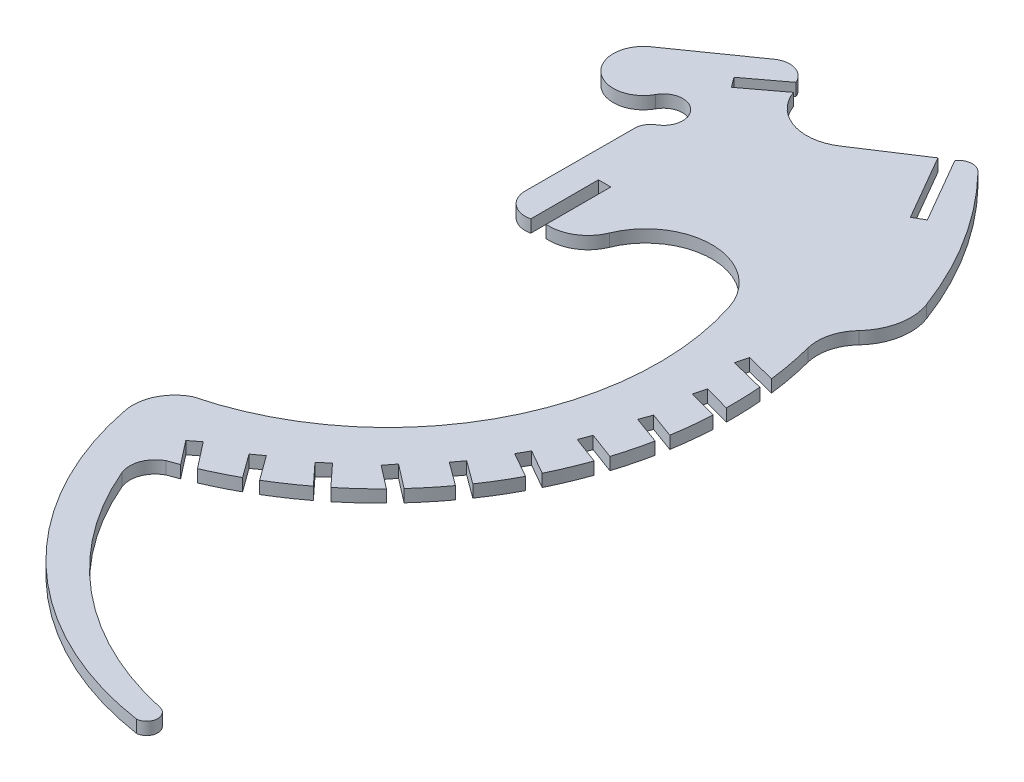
ISO-10303-21;
HEADER;
FILE_DESCRIPTION(('STEP AP214'),'2;1');
FILE_NAME('part.step','',(''),(''),'','','');
FILE_SCHEMA(('AUTOMOTIVE_DESIGN { 1 0 10303 214 1 1 1 1 }'));
ENDSEC;
DATA;
#1=APPLICATION_CONTEXT('core data for automotive mechanical design processes');
#2=APPLICATION_PROTOCOL_DEFINITION('international standard','automotive_design',2000,#1);
#3=PRODUCT_CONTEXT('',#1,'mechanical');
#4=PRODUCT('Part','Part','',(#3));
#5=PRODUCT_RELATED_PRODUCT_CATEGORY('part','',(#4));
#6=PRODUCT_DEFINITION_FORMATION('','',#4);
#7=PRODUCT_DEFINITION_CONTEXT('part definition',#1,'design');
#8=PRODUCT_DEFINITION('design','',#6,#7);
#9=PRODUCT_DEFINITION_SHAPE('','',#8);
#10=(LENGTH_UNIT() NAMED_UNIT(*) SI_UNIT(.MILLI.,.METRE.));
#11=(NAMED_UNIT(*) PLANE_ANGLE_UNIT() SI_UNIT($,.RADIAN.));
#12=(NAMED_UNIT(*) SI_UNIT($,.STERADIAN.) SOLID_ANGLE_UNIT());
#13=UNCERTAINTY_MEASURE_WITH_UNIT(LENGTH_MEASURE(1.E-05),#10,'distance_accuracy_value','');
#14=(GEOMETRIC_REPRESENTATION_CONTEXT(3) GLOBAL_UNCERTAINTY_ASSIGNED_CONTEXT((#13)) GLOBAL_UNIT_ASSIGNED_CONTEXT((#10,
#11,#12)) REPRESENTATION_CONTEXT('',''));
#15=CARTESIAN_POINT('',(0.,0.,0.));
#16=DIRECTION('',(0.,0.,1.));
#17=DIRECTION('',(1.,0.,0.));
#18=AXIS2_PLACEMENT_3D('',#15,#16,#17);
#19=CARTESIAN_POINT('',(-41860.863281,3.,-18247.054687));
#20=DIRECTION('',(-0.679550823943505,0.,-0.73362843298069));
#21=DIRECTION('',(-0.73362843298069,0.,0.679550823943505));
#22=AXIS2_PLACEMENT_3D('',#19,#20,#21);
#23=PLANE('',#22);
#24=DIRECTION('',(0.733628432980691,0.,-0.679550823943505));
#25=VECTOR('',#24,1.);
#26=CARTESIAN_POINT('',(-41860.863281,0.,-18247.054687));
#27=LINE('',#26,#25);
#28=CARTESIAN_POINT('',(-41863.0625,0.,-18245.017578));
#29=VERTEX_POINT('',#28);
#30=CARTESIAN_POINT('',(-41860.863281,0.,-18247.054687));
#31=VERTEX_POINT('',#30);
#32=EDGE_CURVE('E510',#29,#31,#27,.T.);
#33=ORIENTED_EDGE('',*,*,#32,.T.);
#34=DIRECTION('',(0.,-1.,0.));
#35=VECTOR('',#34,1.);
#36=CARTESIAN_POINT('',(-41860.863281,3.,-18247.054687));
#37=LINE('',#36,#35);
#38=CARTESIAN_POINT('',(-41860.863281,3.,-18247.054687));
#39=VERTEX_POINT('',#38);
#40=EDGE_CURVE('E11',#39,#31,#37,.T.);
#41=ORIENTED_EDGE('',*,*,#40,.F.);
#42=DIRECTION('',(0.733628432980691,0.,-0.679550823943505));
#43=VECTOR('',#42,1.);
#44=CARTESIAN_POINT('',(-41860.863281,3.,-18247.054687));
#45=LINE('',#44,#43);
#46=CARTESIAN_POINT('',(-41863.0625,3.,-18245.017578));
#47=VERTEX_POINT('',#46);
#48=EDGE_CURVE('E650',#47,#39,#45,.T.);
#49=ORIENTED_EDGE('',*,*,#48,.F.);
#50=DIRECTION('',(0.,-1.,0.));
#51=VECTOR('',#50,1.);
#52=CARTESIAN_POINT('',(-41863.0625,3.,-18245.017578));
#53=LINE('',#52,#51);
#54=EDGE_CURVE('E506',#47,#29,#53,.T.);
#55=ORIENTED_EDGE('',*,*,#54,.T.);
#56=EDGE_LOOP('',(#33,#41,#49,#55));
#57=FACE_BOUND('',#56,.T.);
#58=ADVANCED_FACE('F36',(#57),#23,.F.);
#59=CARTESIAN_POINT('',(-41855.9432720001,3.,-18241.739256));
#60=DIRECTION('',(0.733876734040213,0.,-0.679282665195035));
#61=DIRECTION('',(-0.679282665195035,0.,-0.733876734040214));
#62=AXIS2_PLACEMENT_3D('',#59,#60,#61);
#63=PLANE('',#62);
#64=DIRECTION('',(0.679282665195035,0.,0.733876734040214));
#65=VECTOR('',#64,1.);
#66=CARTESIAN_POINT('',(-41855.9432720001,0.,-18241.739256));
#67=LINE('',#66,#65);
#68=CARTESIAN_POINT('',(-41855.9432720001,0.,-18241.739256));
#69=VERTEX_POINT('',#68);
#70=EDGE_CURVE('E513',#31,#69,#67,.T.);
#71=ORIENTED_EDGE('',*,*,#70,.T.);
#72=DIRECTION('',(0.,-1.,0.));
#73=VECTOR('',#72,1.);
#74=CARTESIAN_POINT('',(-41855.9432720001,3.,-18241.739256));
#75=LINE('',#74,#73);
#76=CARTESIAN_POINT('',(-41855.9432720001,3.,-18241.739256));
#77=VERTEX_POINT('',#76);
#78=EDGE_CURVE('E44',#77,#69,#75,.T.);
#79=ORIENTED_EDGE('',*,*,#78,.F.);
#80=DIRECTION('',(0.679282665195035,0.,0.733876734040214));
#81=VECTOR('',#80,1.);
#82=CARTESIAN_POINT('',(-41855.9432720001,3.,-18241.739256));
#83=LINE('',#82,#81);
#84=EDGE_CURVE('E284',#39,#77,#83,.T.);
#85=ORIENTED_EDGE('',*,*,#84,.F.);
#86=ORIENTED_EDGE('',*,*,#40,.T.);
#87=EDGE_LOOP('',(#71,#79,#85,#86));
#88=FACE_BOUND('',#87,.T.);
#89=ADVANCED_FACE('F1023',(#88),#63,.F.);
#90=CARTESIAN_POINT('',(-41909.5138521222,3.,-18307.3290802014));
#91=DIRECTION('',(0.,-1.,0.));
#92=DIRECTION('',(0.,0.,-1.));
#93=AXIS2_PLACEMENT_3D('',#90,#91,#92);
#94=CYLINDRICAL_SURFACE('',#93,84.6866701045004);
#95=CARTESIAN_POINT('',(-41909.5138521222,0.,-18307.3290802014));
#96=DIRECTION('',(0.,1.,0.));
#97=DIRECTION('',(0.,0.,1.));
#98=AXIS2_PLACEMENT_3D('',#95,#96,#97);
#99=CIRCLE('',#98,84.6866701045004);
#100=CARTESIAN_POINT('',(-41848.941406,0.,-18248.1445310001));
#101=VERTEX_POINT('',#100);
#102=EDGE_CURVE('E515',#69,#101,#99,.T.);
#103=ORIENTED_EDGE('',*,*,#102,.T.);
#104=DIRECTION('',(0.,-1.,0.));
#105=VECTOR('',#104,1.);
#106=CARTESIAN_POINT('',(-41848.941406,3.,-18248.1445310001));
#107=LINE('',#106,#105);
#108=CARTESIAN_POINT('',(-41848.941406,3.,-18248.1445310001));
#109=VERTEX_POINT('',#108);
#110=EDGE_CURVE('E846',#109,#101,#107,.T.);
#111=ORIENTED_EDGE('',*,*,#110,.F.);
#112=CARTESIAN_POINT('',(-41909.5138521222,3.,-18307.3290802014));
#113=DIRECTION('',(0.,1.,0.));
#114=DIRECTION('',(0.,0.,1.));
#115=AXIS2_PLACEMENT_3D('',#112,#113,#114);
#116=CIRCLE('',#115,84.6866701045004);
#117=EDGE_CURVE('E854',#77,#109,#116,.T.);
#118=ORIENTED_EDGE('',*,*,#117,.F.);
#119=ORIENTED_EDGE('',*,*,#78,.T.);
#120=EDGE_LOOP('',(#103,#111,#118,#119));
#121=FACE_BOUND('',#120,.T.);
#122=ADVANCED_FACE('F852',(#121),#94,.T.);
#123=CARTESIAN_POINT('',(-41854.503906,3.,-18252.429687));
#124=DIRECTION('',(-0.610275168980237,0.,0.792189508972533));
#125=DIRECTION('',(0.792189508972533,0.,0.610275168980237));
#126=AXIS2_PLACEMENT_3D('',#123,#124,#125);
#127=PLANE('',#126);
#128=DIRECTION('',(-0.792189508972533,0.,-0.610275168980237));
#129=VECTOR('',#128,1.);
#130=CARTESIAN_POINT('',(-41854.503906,0.,-18252.429687));
#131=LINE('',#130,#129);
#132=CARTESIAN_POINT('',(-41854.503906,0.,-18252.429687));
#133=VERTEX_POINT('',#132);
#134=EDGE_CURVE('E517',#101,#133,#131,.T.);
#135=ORIENTED_EDGE('',*,*,#134,.T.);
#136=DIRECTION('',(0.,-1.,0.));
#137=VECTOR('',#136,1.);
#138=CARTESIAN_POINT('',(-41854.503906,3.,-18252.429687));
#139=LINE('',#138,#137);
#140=CARTESIAN_POINT('',(-41854.503906,3.,-18252.429687));
#141=VERTEX_POINT('',#140);
#142=EDGE_CURVE('E843',#141,#133,#139,.T.);
#143=ORIENTED_EDGE('',*,*,#142,.F.);
#144=DIRECTION('',(-0.792189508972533,0.,-0.610275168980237));
#145=VECTOR('',#144,1.);
#146=CARTESIAN_POINT('',(-41854.503906,3.,-18252.429687));
#147=LINE('',#146,#145);
#148=EDGE_CURVE('E872',#109,#141,#147,.T.);
#149=ORIENTED_EDGE('',*,*,#148,.F.);
#150=ORIENTED_EDGE('',*,*,#110,.T.);
#151=EDGE_LOOP('',(#135,#143,#149,#150));
#152=FACE_BOUND('',#151,.T.);
#153=ADVANCED_FACE('F863',(#152),#127,.F.);
#154=CARTESIAN_POINT('',(-41852.671875,3.,-18254.804687));
#155=DIRECTION('',(-0.791800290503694,0.,-0.610780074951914));
#156=DIRECTION('',(-0.610780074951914,0.,0.791800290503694));
#157=AXIS2_PLACEMENT_3D('',#154,#155,#156);
#158=PLANE('',#157);
#159=DIRECTION('',(0.610780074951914,0.,-0.791800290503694));
#160=VECTOR('',#159,1.);
#161=CARTESIAN_POINT('',(-41852.671875,0.,-18254.804687));
#162=LINE('',#161,#160);
#163=CARTESIAN_POINT('',(-41852.671875,0.,-18254.804687));
#164=VERTEX_POINT('',#163);
#165=EDGE_CURVE('E519',#133,#164,#162,.T.);
#166=ORIENTED_EDGE('',*,*,#165,.T.);
#167=DIRECTION('',(0.,-1.,0.));
#168=VECTOR('',#167,1.);
#169=CARTESIAN_POINT('',(-41852.671875,3.,-18254.804687));
#170=LINE('',#169,#168);
#171=CARTESIAN_POINT('',(-41852.671875,3.,-18254.804687));
#172=VERTEX_POINT('',#171);
#173=EDGE_CURVE('E840',#172,#164,#170,.T.);
#174=ORIENTED_EDGE('',*,*,#173,.F.);
#175=DIRECTION('',(0.610780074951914,0.,-0.791800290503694));
#176=VECTOR('',#175,1.);
#177=CARTESIAN_POINT('',(-41852.671875,3.,-18254.804687));
#178=LINE('',#177,#176);
#179=EDGE_CURVE('E869',#141,#172,#178,.T.);
#180=ORIENTED_EDGE('',*,*,#179,.F.);
#181=ORIENTED_EDGE('',*,*,#142,.T.);
#182=EDGE_LOOP('',(#166,#174,#180,#181));
#183=FACE_BOUND('',#182,.T.);
#184=ADVANCED_FACE('F867',(#183),#158,.F.);
#185=CARTESIAN_POINT('',(-41846.87312,3.,-18250.3409579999));
#186=DIRECTION('',(0.609981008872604,0.,-0.792416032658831));
#187=DIRECTION('',(-0.792416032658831,0.,-0.609981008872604));
#188=AXIS2_PLACEMENT_3D('',#185,#186,#187);
#189=PLANE('',#188);
#190=DIRECTION('',(0.792416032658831,0.,0.609981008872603));
#191=VECTOR('',#190,1.);
#192=CARTESIAN_POINT('',(-41846.87312,0.,-18250.3409579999));
#193=LINE('',#192,#191);
#194=CARTESIAN_POINT('',(-41846.87312,0.,-18250.3409579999));
#195=VERTEX_POINT('',#194);
#196=EDGE_CURVE('E521',#164,#195,#193,.T.);
#197=ORIENTED_EDGE('',*,*,#196,.T.);
#198=DIRECTION('',(0.,-1.,0.));
#199=VECTOR('',#198,1.);
#200=CARTESIAN_POINT('',(-41846.87312,3.,-18250.3409579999));
#201=LINE('',#200,#199);
#202=CARTESIAN_POINT('',(-41846.87312,3.,-18250.3409579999));
#203=VERTEX_POINT('',#202);
#204=EDGE_CURVE('E837',#203,#195,#201,.T.);
#205=ORIENTED_EDGE('',*,*,#204,.F.);
#206=DIRECTION('',(0.792416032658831,0.,0.609981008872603));
#207=VECTOR('',#206,1.);
#208=CARTESIAN_POINT('',(-41846.87312,3.,-18250.3409579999));
#209=LINE('',#208,#207);
#210=EDGE_CURVE('E871',#172,#203,#209,.T.);
#211=ORIENTED_EDGE('',*,*,#210,.F.);
#212=ORIENTED_EDGE('',*,*,#173,.T.);
#213=EDGE_LOOP('',(#197,#205,#211,#212));
#214=FACE_BOUND('',#213,.T.);
#215=ADVANCED_FACE('F1036',(#214),#189,.F.);
#216=CARTESIAN_POINT('',(-41909.5069663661,3.,-18307.3404200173));
#217=DIRECTION('',(0.,-1.,0.));
#218=DIRECTION('',(0.,0.,-1.));
#219=AXIS2_PLACEMENT_3D('',#216,#217,#218);
#220=CYLINDRICAL_SURFACE('',#219,84.6872917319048);
#221=CARTESIAN_POINT('',(-41909.5069663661,0.,-18307.3404200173));
#222=DIRECTION('',(0.,1.,0.));
#223=DIRECTION('',(0.,0.,1.));
#224=AXIS2_PLACEMENT_3D('',#221,#222,#223);
#225=CIRCLE('',#224,84.6872917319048);
#226=CARTESIAN_POINT('',(-41841.2890619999,0.,-18257.158203));
#227=VERTEX_POINT('',#226);
#228=EDGE_CURVE('E523',#195,#227,#225,.T.);
#229=ORIENTED_EDGE('',*,*,#228,.T.);
#230=DIRECTION('',(0.,-1.,0.));
#231=VECTOR('',#230,1.);
#232=CARTESIAN_POINT('',(-41841.2890619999,3.,-18257.158203));
#233=LINE('',#232,#231);
#234=CARTESIAN_POINT('',(-41841.2890619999,3.,-18257.158203));
#235=VERTEX_POINT('',#234);
#236=EDGE_CURVE('E834',#235,#227,#233,.T.);
#237=ORIENTED_EDGE('',*,*,#236,.F.);
#238=CARTESIAN_POINT('',(-41909.5069663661,3.,-18307.3404200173));
#239=DIRECTION('',(0.,1.,0.));
#240=DIRECTION('',(0.,0.,1.));
#241=AXIS2_PLACEMENT_3D('',#238,#239,#240);
#242=CIRCLE('',#241,84.6872917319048);
#243=EDGE_CURVE('E874',#203,#235,#242,.T.);
#244=ORIENTED_EDGE('',*,*,#243,.F.);
#245=ORIENTED_EDGE('',*,*,#204,.T.);
#246=EDGE_LOOP('',(#229,#237,#244,#245));
#247=FACE_BOUND('',#246,.T.);
#248=ADVANCED_FACE('F1039',(#247),#220,.T.);
#249=CARTESIAN_POINT('',(-41846.914062,3.,-18261.296875));
#250=DIRECTION('',(-0.592636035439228,0.,0.805470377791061));
#251=DIRECTION('',(0.805470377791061,0.,0.592636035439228));
#252=AXIS2_PLACEMENT_3D('',#249,#250,#251);
#253=PLANE('',#252);
#254=DIRECTION('',(-0.805470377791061,0.,-0.592636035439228));
#255=VECTOR('',#254,1.);
#256=CARTESIAN_POINT('',(-41846.914062,0.,-18261.296875));
#257=LINE('',#256,#255);
#258=CARTESIAN_POINT('',(-41846.914062,0.,-18261.296875));
#259=VERTEX_POINT('',#258);
#260=EDGE_CURVE('E525',#227,#259,#257,.T.);
#261=ORIENTED_EDGE('',*,*,#260,.T.);
#262=DIRECTION('',(0.,-1.,0.));
#263=VECTOR('',#262,1.);
#264=CARTESIAN_POINT('',(-41846.914062,3.,-18261.296875));
#265=LINE('',#264,#263);
#266=CARTESIAN_POINT('',(-41846.914062,3.,-18261.296875));
#267=VERTEX_POINT('',#266);
#268=EDGE_CURVE('E831',#267,#259,#265,.T.);
#269=ORIENTED_EDGE('',*,*,#268,.F.);
#270=DIRECTION('',(-0.805470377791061,0.,-0.592636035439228));
#271=VECTOR('',#270,1.);
#272=CARTESIAN_POINT('',(-41846.914062,3.,-18261.296875));
#273=LINE('',#272,#271);
#274=EDGE_CURVE('E880',#235,#267,#273,.T.);
#275=ORIENTED_EDGE('',*,*,#274,.F.);
#276=ORIENTED_EDGE('',*,*,#236,.T.);
#277=EDGE_LOOP('',(#261,#269,#275,#276));
#278=FACE_BOUND('',#277,.T.);
#279=ADVANCED_FACE('F1043',(#278),#253,.F.);
#280=CARTESIAN_POINT('',(-41845.132812,3.,-18263.712891));
#281=DIRECTION('',(-0.804892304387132,0.,-0.593420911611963));
#282=DIRECTION('',(-0.593420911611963,0.,0.804892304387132));
#283=AXIS2_PLACEMENT_3D('',#280,#281,#282);
#284=PLANE('',#283);
#285=DIRECTION('',(0.593420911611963,0.,-0.804892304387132));
#286=VECTOR('',#285,1.);
#287=CARTESIAN_POINT('',(-41845.132812,0.,-18263.712891));
#288=LINE('',#287,#286);
#289=CARTESIAN_POINT('',(-41845.132812,0.,-18263.712891));
#290=VERTEX_POINT('',#289);
#291=EDGE_CURVE('E527',#259,#290,#288,.T.);
#292=ORIENTED_EDGE('',*,*,#291,.T.);
#293=DIRECTION('',(0.,-1.,0.));
#294=VECTOR('',#293,1.);
#295=CARTESIAN_POINT('',(-41845.132812,3.,-18263.712891));
#296=LINE('',#295,#294);
#297=CARTESIAN_POINT('',(-41845.132812,3.,-18263.712891));
#298=VERTEX_POINT('',#297);
#299=EDGE_CURVE('E828',#298,#290,#296,.T.);
#300=ORIENTED_EDGE('',*,*,#299,.F.);
#301=DIRECTION('',(0.593420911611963,0.,-0.804892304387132));
#302=VECTOR('',#301,1.);
#303=CARTESIAN_POINT('',(-41845.132812,3.,-18263.712891));
#304=LINE('',#303,#302);
#305=EDGE_CURVE('E882',#267,#298,#304,.T.);
#306=ORIENTED_EDGE('',*,*,#305,.F.);
#307=ORIENTED_EDGE('',*,*,#268,.T.);
#308=EDGE_LOOP('',(#292,#300,#306,#307));
#309=FACE_BOUND('',#308,.T.);
#310=ADVANCED_FACE('F1047',(#309),#284,.F.);
#311=CARTESIAN_POINT('',(-41839.555148,3.,-18259.6113250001));
#312=DIRECTION('',(0.592422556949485,0.,-0.805627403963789));
#313=DIRECTION('',(-0.805627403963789,0.,-0.592422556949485));
#314=AXIS2_PLACEMENT_3D('',#311,#312,#313);
#315=PLANE('',#314);
#316=DIRECTION('',(0.805627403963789,0.,0.592422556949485));
#317=VECTOR('',#316,1.);
#318=CARTESIAN_POINT('',(-41839.555148,0.,-18259.6113250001));
#319=LINE('',#318,#317);
#320=CARTESIAN_POINT('',(-41839.555148,0.,-18259.6113250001));
#321=VERTEX_POINT('',#320);
#322=EDGE_CURVE('E529',#290,#321,#319,.T.);
#323=ORIENTED_EDGE('',*,*,#322,.T.);
#324=DIRECTION('',(0.,-1.,0.));
#325=VECTOR('',#324,1.);
#326=CARTESIAN_POINT('',(-41839.555148,3.,-18259.6113250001));
#327=LINE('',#326,#325);
#328=CARTESIAN_POINT('',(-41839.555148,3.,-18259.6113250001));
#329=VERTEX_POINT('',#328);
#330=EDGE_CURVE('E825',#329,#321,#327,.T.);
#331=ORIENTED_EDGE('',*,*,#330,.F.);
#332=DIRECTION('',(0.805627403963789,0.,0.592422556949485));
#333=VECTOR('',#332,1.);
#334=CARTESIAN_POINT('',(-41839.555148,3.,-18259.6113250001));
#335=LINE('',#334,#333);
#336=EDGE_CURVE('E884',#298,#329,#335,.T.);
#337=ORIENTED_EDGE('',*,*,#336,.F.);
#338=ORIENTED_EDGE('',*,*,#299,.T.);
#339=EDGE_LOOP('',(#323,#331,#337,#338));
#340=FACE_BOUND('',#339,.T.);
#341=ADVANCED_FACE('F1051',(#340),#315,.F.);
#342=CARTESIAN_POINT('',(-41909.5278295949,3.,-18307.3130436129));
#343=DIRECTION('',(0.,-1.,0.));
#344=DIRECTION('',(0.,0.,-1.));
#345=AXIS2_PLACEMENT_3D('',#342,#343,#344);
#346=CYLINDRICAL_SURFACE('',#345,84.6854776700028);
#347=CARTESIAN_POINT('',(-41909.5278295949,0.,-18307.3130436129));
#348=DIRECTION('',(0.,1.,0.));
#349=DIRECTION('',(0.,0.,1.));
#350=AXIS2_PLACEMENT_3D('',#347,#348,#349);
#351=CIRCLE('',#350,84.6854776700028);
#352=CARTESIAN_POINT('',(-41834.761719,0.,-18267.542969));
#353=VERTEX_POINT('',#352);
#354=EDGE_CURVE('E531',#321,#353,#351,.T.);
#355=ORIENTED_EDGE('',*,*,#354,.T.);
#356=DIRECTION('',(0.,-1.,0.));
#357=VECTOR('',#356,1.);
#358=CARTESIAN_POINT('',(-41834.761719,3.,-18267.542969));
#359=LINE('',#358,#357);
#360=CARTESIAN_POINT('',(-41834.761719,3.,-18267.542969));
#361=VERTEX_POINT('',#360);
#362=EDGE_CURVE('E822',#361,#353,#359,.T.);
#363=ORIENTED_EDGE('',*,*,#362,.F.);
#364=CARTESIAN_POINT('',(-41909.5278295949,3.,-18307.3130436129));
#365=DIRECTION('',(0.,1.,0.));
#366=DIRECTION('',(0.,0.,1.));
#367=AXIS2_PLACEMENT_3D('',#364,#365,#366);
#368=CIRCLE('',#367,84.6854776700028);
#369=EDGE_CURVE('E886',#329,#361,#368,.T.);
#370=ORIENTED_EDGE('',*,*,#369,.F.);
#371=ORIENTED_EDGE('',*,*,#330,.T.);
#372=EDGE_LOOP('',(#355,#363,#370,#371));
#373=FACE_BOUND('',#372,.T.);
#374=ADVANCED_FACE('F1055',(#373),#346,.T.);
#375=CARTESIAN_POINT('',(-41840.820312,3.,-18270.990234));
#376=DIRECTION('',(-0.494538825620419,0.,0.869155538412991));
#377=DIRECTION('',(0.869155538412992,0.,0.494538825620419));
#378=AXIS2_PLACEMENT_3D('',#375,#376,#377);
#379=PLANE('',#378);
#380=DIRECTION('',(-0.869155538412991,0.,-0.494538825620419));
#381=VECTOR('',#380,1.);
#382=CARTESIAN_POINT('',(-41840.820312,0.,-18270.990234));
#383=LINE('',#382,#381);
#384=CARTESIAN_POINT('',(-41840.820312,0.,-18270.990234));
#385=VERTEX_POINT('',#384);
#386=EDGE_CURVE('E533',#353,#385,#383,.T.);
#387=ORIENTED_EDGE('',*,*,#386,.T.);
#388=DIRECTION('',(0.,-1.,0.));
#389=VECTOR('',#388,1.);
#390=CARTESIAN_POINT('',(-41840.820312,3.,-18270.990234));
#391=LINE('',#390,#389);
#392=CARTESIAN_POINT('',(-41840.820312,3.,-18270.990234));
#393=VERTEX_POINT('',#392);
#394=EDGE_CURVE('E819',#393,#385,#391,.T.);
#395=ORIENTED_EDGE('',*,*,#394,.F.);
#396=DIRECTION('',(-0.869155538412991,0.,-0.494538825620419));
#397=VECTOR('',#396,1.);
#398=CARTESIAN_POINT('',(-41840.820312,3.,-18270.990234));
#399=LINE('',#398,#397);
#400=EDGE_CURVE('E888',#361,#393,#399,.T.);
#401=ORIENTED_EDGE('',*,*,#400,.F.);
#402=ORIENTED_EDGE('',*,*,#362,.T.);
#403=EDGE_LOOP('',(#387,#395,#401,#402));
#404=FACE_BOUND('',#403,.T.);
#405=ADVANCED_FACE('F1059',(#404),#379,.F.);
#406=CARTESIAN_POINT('',(-41839.335937,3.,-18273.597656));
#407=DIRECTION('',(-0.869043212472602,0.,-0.494736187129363));
#408=DIRECTION('',(-0.494736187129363,0.,0.869043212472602));
#409=AXIS2_PLACEMENT_3D('',#406,#407,#408);
#410=PLANE('',#409);
#411=DIRECTION('',(0.494736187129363,0.,-0.869043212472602));
#412=VECTOR('',#411,1.);
#413=CARTESIAN_POINT('',(-41839.335937,0.,-18273.597656));
#414=LINE('',#413,#412);
#415=CARTESIAN_POINT('',(-41839.335937,0.,-18273.597656));
#416=VERTEX_POINT('',#415);
#417=EDGE_CURVE('E535',#385,#416,#414,.T.);
#418=ORIENTED_EDGE('',*,*,#417,.T.);
#419=DIRECTION('',(0.,-1.,0.));
#420=VECTOR('',#419,1.);
#421=CARTESIAN_POINT('',(-41839.335937,3.,-18273.597656));
#422=LINE('',#421,#420);
#423=CARTESIAN_POINT('',(-41839.335937,3.,-18273.597656));
#424=VERTEX_POINT('',#423);
#425=EDGE_CURVE('E816',#424,#416,#422,.T.);
#426=ORIENTED_EDGE('',*,*,#425,.F.);
#427=DIRECTION('',(0.494736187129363,0.,-0.869043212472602));
#428=VECTOR('',#427,1.);
#429=CARTESIAN_POINT('',(-41839.335937,3.,-18273.597656));
#430=LINE('',#429,#428);
#431=EDGE_CURVE('E890',#393,#424,#430,.T.);
#432=ORIENTED_EDGE('',*,*,#431,.F.);
#433=ORIENTED_EDGE('',*,*,#394,.T.);
#434=EDGE_LOOP('',(#418,#426,#432,#433));
#435=FACE_BOUND('',#434,.T.);
#436=ADVANCED_FACE('F1063',(#435),#410,.F.);
#437=CARTESIAN_POINT('',(-41833.398663,3.,-18270.21603));
#438=DIRECTION('',(0.49491358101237,0.,-0.868942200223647));
#439=DIRECTION('',(-0.868942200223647,0.,-0.49491358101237));
#440=AXIS2_PLACEMENT_3D('',#437,#438,#439);
#441=PLANE('',#440);
#442=DIRECTION('',(0.868942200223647,0.,0.49491358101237));
#443=VECTOR('',#442,1.);
#444=CARTESIAN_POINT('',(-41833.398663,0.,-18270.21603));
#445=LINE('',#444,#443);
#446=CARTESIAN_POINT('',(-41833.398663,0.,-18270.21603));
#447=VERTEX_POINT('',#446);
#448=EDGE_CURVE('E537',#416,#447,#445,.T.);
#449=ORIENTED_EDGE('',*,*,#448,.T.);
#450=DIRECTION('',(0.,-1.,0.));
#451=VECTOR('',#450,1.);
#452=CARTESIAN_POINT('',(-41833.398663,3.,-18270.21603));
#453=LINE('',#452,#451);
#454=CARTESIAN_POINT('',(-41833.398663,3.,-18270.21603));
#455=VERTEX_POINT('',#454);
#456=EDGE_CURVE('E813',#455,#447,#453,.T.);
#457=ORIENTED_EDGE('',*,*,#456,.F.);
#458=DIRECTION('',(0.868942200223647,0.,0.49491358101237));
#459=VECTOR('',#458,1.);
#460=CARTESIAN_POINT('',(-41833.398663,3.,-18270.21603));
#461=LINE('',#460,#459);
#462=EDGE_CURVE('E892',#424,#455,#461,.T.);
#463=ORIENTED_EDGE('',*,*,#462,.F.);
#464=ORIENTED_EDGE('',*,*,#425,.T.);
#465=EDGE_LOOP('',(#449,#457,#463,#464));
#466=FACE_BOUND('',#465,.T.);
#467=ADVANCED_FACE('F1067',(#466),#441,.F.);
#468=CARTESIAN_POINT('',(-41909.5229131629,3.,-18307.3215613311));
#469=DIRECTION('',(0.,-1.,0.));
#470=DIRECTION('',(0.,0.,-1.));
#471=AXIS2_PLACEMENT_3D('',#468,#469,#470);
#472=CYLINDRICAL_SURFACE('',#471,84.6860196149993);
#473=CARTESIAN_POINT('',(-41909.5229131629,0.,-18307.3215613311));
#474=DIRECTION('',(0.,1.,0.));
#475=DIRECTION('',(0.,0.,1.));
#476=AXIS2_PLACEMENT_3D('',#473,#474,#475);
#477=CIRCLE('',#476,84.6860196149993);
#478=CARTESIAN_POINT('',(-41829.699219,0.,-18279.0390619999));
#479=VERTEX_POINT('',#478);
#480=EDGE_CURVE('E539',#447,#479,#477,.T.);
#481=ORIENTED_EDGE('',*,*,#480,.T.);
#482=DIRECTION('',(0.,-1.,0.));
#483=VECTOR('',#482,1.);
#484=CARTESIAN_POINT('',(-41829.699219,3.,-18279.0390619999));
#485=LINE('',#484,#483);
#486=CARTESIAN_POINT('',(-41829.699219,3.,-18279.0390619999));
#487=VERTEX_POINT('',#486);
#488=EDGE_CURVE('E810',#487,#479,#485,.T.);
#489=ORIENTED_EDGE('',*,*,#488,.F.);
#490=CARTESIAN_POINT('',(-41909.5229131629,3.,-18307.3215613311));
#491=DIRECTION('',(0.,1.,0.));
#492=DIRECTION('',(0.,0.,1.));
#493=AXIS2_PLACEMENT_3D('',#490,#491,#492);
#494=CIRCLE('',#493,84.6860196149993);
#495=EDGE_CURVE('E894',#455,#487,#494,.T.);
#496=ORIENTED_EDGE('',*,*,#495,.F.);
#497=ORIENTED_EDGE('',*,*,#456,.T.);
#498=EDGE_LOOP('',(#481,#489,#496,#497));
#499=FACE_BOUND('',#498,.T.);
#500=ADVANCED_FACE('F1071',(#499),#472,.T.);
#501=CARTESIAN_POINT('',(-41836.226562,3.,-18281.482422));
#502=DIRECTION('',(-0.350570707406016,0.,0.936536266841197));
#503=DIRECTION('',(0.936536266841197,0.,0.350570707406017));
#504=AXIS2_PLACEMENT_3D('',#501,#502,#503);
#505=PLANE('',#504);
#506=DIRECTION('',(-0.936536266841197,0.,-0.350570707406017));
#507=VECTOR('',#506,1.);
#508=CARTESIAN_POINT('',(-41836.226562,0.,-18281.482422));
#509=LINE('',#508,#507);
#510=CARTESIAN_POINT('',(-41836.226562,0.,-18281.482422));
#511=VERTEX_POINT('',#510);
#512=EDGE_CURVE('E541',#479,#511,#509,.T.);
#513=ORIENTED_EDGE('',*,*,#512,.T.);
#514=DIRECTION('',(0.,-1.,0.));
#515=VECTOR('',#514,1.);
#516=CARTESIAN_POINT('',(-41836.226562,3.,-18281.482422));
#517=LINE('',#516,#515);
#518=CARTESIAN_POINT('',(-41836.226562,3.,-18281.482422));
#519=VERTEX_POINT('',#518);
#520=EDGE_CURVE('E807',#519,#511,#517,.T.);
#521=ORIENTED_EDGE('',*,*,#520,.F.);
#522=DIRECTION('',(-0.936536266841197,0.,-0.350570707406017));
#523=VECTOR('',#522,1.);
#524=CARTESIAN_POINT('',(-41836.226562,3.,-18281.482422));
#525=LINE('',#524,#523);
#526=EDGE_CURVE('E896',#487,#519,#525,.T.);
#527=ORIENTED_EDGE('',*,*,#526,.F.);
#528=ORIENTED_EDGE('',*,*,#488,.T.);
#529=EDGE_LOOP('',(#513,#521,#527,#528));
#530=FACE_BOUND('',#529,.T.);
#531=ADVANCED_FACE('F1075',(#530),#505,.F.);
#532=CARTESIAN_POINT('',(-41835.171875,3.,-18284.291016));
#533=DIRECTION('',(-0.936168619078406,0.,-0.351551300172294));
#534=DIRECTION('',(-0.351551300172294,0.,0.936168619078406));
#535=AXIS2_PLACEMENT_3D('',#532,#533,#534);
#536=PLANE('',#535);
#537=DIRECTION('',(0.351551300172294,0.,-0.936168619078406));
#538=VECTOR('',#537,1.);
#539=CARTESIAN_POINT('',(-41835.171875,0.,-18284.291016));
#540=LINE('',#539,#538);
#541=CARTESIAN_POINT('',(-41835.171875,0.,-18284.291016));
#542=VERTEX_POINT('',#541);
#543=EDGE_CURVE('E543',#511,#542,#540,.T.);
#544=ORIENTED_EDGE('',*,*,#543,.T.);
#545=DIRECTION('',(0.,-1.,0.));
#546=VECTOR('',#545,1.);
#547=CARTESIAN_POINT('',(-41835.171875,3.,-18284.291016));
#548=LINE('',#547,#546);
#549=CARTESIAN_POINT('',(-41835.171875,3.,-18284.291016));
#550=VERTEX_POINT('',#549);
#551=EDGE_CURVE('E804',#550,#542,#548,.T.);
#552=ORIENTED_EDGE('',*,*,#551,.F.);
#553=DIRECTION('',(0.351551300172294,0.,-0.936168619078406));
#554=VECTOR('',#553,1.);
#555=CARTESIAN_POINT('',(-41835.171875,3.,-18284.291016));
#556=LINE('',#555,#554);
#557=EDGE_CURVE('E898',#519,#550,#556,.T.);
#558=ORIENTED_EDGE('',*,*,#557,.F.);
#559=ORIENTED_EDGE('',*,*,#520,.T.);
#560=EDGE_LOOP('',(#544,#552,#558,#559));
#561=FACE_BOUND('',#560,.T.);
#562=ADVANCED_FACE('F1079',(#561),#536,.F.);
#563=CARTESIAN_POINT('',(-41828.746206,3.,-18281.889075));
#564=DIRECTION('',(0.350141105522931,0.,-0.93669696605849));
#565=DIRECTION('',(-0.93669696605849,0.,-0.350141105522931));
#566=AXIS2_PLACEMENT_3D('',#563,#564,#565);
#567=PLANE('',#566);
#568=DIRECTION('',(0.93669696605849,0.,0.350141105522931));
#569=VECTOR('',#568,1.);
#570=CARTESIAN_POINT('',(-41828.746206,0.,-18281.889075));
#571=LINE('',#570,#569);
#572=CARTESIAN_POINT('',(-41828.746206,0.,-18281.889075));
#573=VERTEX_POINT('',#572);
#574=EDGE_CURVE('E545',#542,#573,#571,.T.);
#575=ORIENTED_EDGE('',*,*,#574,.T.);
#576=DIRECTION('',(0.,-1.,0.));
#577=VECTOR('',#576,1.);
#578=CARTESIAN_POINT('',(-41828.746206,3.,-18281.889075));
#579=LINE('',#578,#577);
#580=CARTESIAN_POINT('',(-41828.746206,3.,-18281.889075));
#581=VERTEX_POINT('',#580);
#582=EDGE_CURVE('E801',#581,#573,#579,.T.);
#583=ORIENTED_EDGE('',*,*,#582,.F.);
#584=DIRECTION('',(0.93669696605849,0.,0.350141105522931));
#585=VECTOR('',#584,1.);
#586=CARTESIAN_POINT('',(-41828.746206,3.,-18281.889075));
#587=LINE('',#586,#585);
#588=EDGE_CURVE('E900',#550,#581,#587,.T.);
#589=ORIENTED_EDGE('',*,*,#588,.F.);
#590=ORIENTED_EDGE('',*,*,#551,.T.);
#591=EDGE_LOOP('',(#575,#583,#589,#590));
#592=FACE_BOUND('',#591,.T.);
#593=ADVANCED_FACE('F1083',(#592),#567,.F.);
#594=CARTESIAN_POINT('',(-41909.5172038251,3.,-18307.3444863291));
#595=DIRECTION('',(0.,-1.,0.));
#596=DIRECTION('',(0.,0.,-1.));
#597=AXIS2_PLACEMENT_3D('',#594,#595,#596);
#598=CYLINDRICAL_SURFACE('',#597,84.6872602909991);
#599=CARTESIAN_POINT('',(-41909.5172038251,0.,-18307.3444863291));
#600=DIRECTION('',(0.,1.,0.));
#601=DIRECTION('',(0.,0.,1.));
#602=AXIS2_PLACEMENT_3D('',#599,#600,#601);
#603=CIRCLE('',#602,84.6872602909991);
#604=CARTESIAN_POINT('',(-41826.507812,0.,-18290.570312));
#605=VERTEX_POINT('',#604);
#606=EDGE_CURVE('E547',#573,#605,#603,.T.);
#607=ORIENTED_EDGE('',*,*,#606,.T.);
#608=DIRECTION('',(0.,-1.,0.));
#609=VECTOR('',#608,1.);
#610=CARTESIAN_POINT('',(-41826.507812,3.,-18290.570312));
#611=LINE('',#610,#609);
#612=CARTESIAN_POINT('',(-41826.507812,3.,-18290.570312));
#613=VERTEX_POINT('',#612);
#614=EDGE_CURVE('E798',#613,#605,#611,.T.);
#615=ORIENTED_EDGE('',*,*,#614,.F.);
#616=CARTESIAN_POINT('',(-41909.5172038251,3.,-18307.3444863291));
#617=DIRECTION('',(0.,1.,0.));
#618=DIRECTION('',(0.,0.,1.));
#619=AXIS2_PLACEMENT_3D('',#616,#617,#618);
#620=CIRCLE('',#619,84.6872602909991);
#621=EDGE_CURVE('E902',#581,#613,#620,.T.);
#622=ORIENTED_EDGE('',*,*,#621,.F.);
#623=ORIENTED_EDGE('',*,*,#582,.T.);
#624=EDGE_LOOP('',(#607,#615,#622,#623));
#625=FACE_BOUND('',#624,.T.);
#626=ADVANCED_FACE('F1087',(#625),#598,.T.);
#627=CARTESIAN_POINT('',(-41833.136719,3.,-18292.998047));
#628=DIRECTION('',(-0.343896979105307,0.,0.939007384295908));
#629=DIRECTION('',(0.939007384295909,0.,0.343896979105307));
#630=AXIS2_PLACEMENT_3D('',#627,#628,#629);
#631=PLANE('',#630);
#632=DIRECTION('',(-0.939007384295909,0.,-0.343896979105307));
#633=VECTOR('',#632,1.);
#634=CARTESIAN_POINT('',(-41833.136719,0.,-18292.998047));
#635=LINE('',#634,#633);
#636=CARTESIAN_POINT('',(-41833.136719,0.,-18292.998047));
#637=VERTEX_POINT('',#636);
#638=EDGE_CURVE('E549',#605,#637,#635,.T.);
#639=ORIENTED_EDGE('',*,*,#638,.T.);
#640=DIRECTION('',(0.,-1.,0.));
#641=VECTOR('',#640,1.);
#642=CARTESIAN_POINT('',(-41833.136719,3.,-18292.998047));
#643=LINE('',#642,#641);
#644=CARTESIAN_POINT('',(-41833.136719,3.,-18292.998047));
#645=VERTEX_POINT('',#644);
#646=EDGE_CURVE('E795',#645,#637,#643,.T.);
#647=ORIENTED_EDGE('',*,*,#646,.F.);
#648=DIRECTION('',(-0.939007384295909,0.,-0.343896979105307));
#649=VECTOR('',#648,1.);
#650=CARTESIAN_POINT('',(-41833.136719,3.,-18292.998047));
#651=LINE('',#650,#649);
#652=EDGE_CURVE('E904',#613,#645,#651,.T.);
#653=ORIENTED_EDGE('',*,*,#652,.F.);
#654=ORIENTED_EDGE('',*,*,#614,.T.);
#655=EDGE_LOOP('',(#639,#647,#653,#654));
#656=FACE_BOUND('',#655,.T.);
#657=ADVANCED_FACE('F1091',(#656),#631,.F.);
#658=CARTESIAN_POINT('',(-41832.105469,3.,-18295.816406));
#659=DIRECTION('',(-0.939107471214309,0.,-0.343623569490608));
#660=DIRECTION('',(-0.343623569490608,0.,0.939107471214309));
#661=AXIS2_PLACEMENT_3D('',#658,#659,#660);
#662=PLANE('',#661);
#663=DIRECTION('',(0.343623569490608,0.,-0.939107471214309));
#664=VECTOR('',#663,1.);
#665=CARTESIAN_POINT('',(-41832.105469,0.,-18295.816406));
#666=LINE('',#665,#664);
#667=CARTESIAN_POINT('',(-41832.105469,0.,-18295.816406));
#668=VERTEX_POINT('',#667);
#669=EDGE_CURVE('E551',#637,#668,#666,.T.);
#670=ORIENTED_EDGE('',*,*,#669,.T.);
#671=DIRECTION('',(0.,-1.,0.));
#672=VECTOR('',#671,1.);
#673=CARTESIAN_POINT('',(-41832.105469,3.,-18295.816406));
#674=LINE('',#673,#672);
#675=CARTESIAN_POINT('',(-41832.105469,3.,-18295.816406));
#676=VERTEX_POINT('',#675);
#677=EDGE_CURVE('E792',#676,#668,#674,.T.);
#678=ORIENTED_EDGE('',*,*,#677,.F.);
#679=DIRECTION('',(0.343623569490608,0.,-0.939107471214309));
#680=VECTOR('',#679,1.);
#681=CARTESIAN_POINT('',(-41832.105469,3.,-18295.816406));
#682=LINE('',#681,#680);
#683=EDGE_CURVE('E906',#645,#676,#682,.T.);
#684=ORIENTED_EDGE('',*,*,#683,.F.);
#685=ORIENTED_EDGE('',*,*,#646,.T.);
#686=EDGE_LOOP('',(#670,#678,#684,#685));
#687=FACE_BOUND('',#686,.T.);
#688=ADVANCED_FACE('F1095',(#687),#662,.F.);
#689=CARTESIAN_POINT('',(-41825.96187,3.,-18293.5662770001));
#690=DIRECTION('',(0.343914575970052,0.,-0.939000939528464));
#691=DIRECTION('',(-0.939000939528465,0.,-0.343914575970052));
#692=AXIS2_PLACEMENT_3D('',#689,#690,#691);
#693=PLANE('',#692);
#694=DIRECTION('',(0.939000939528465,0.,0.343914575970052));
#695=VECTOR('',#694,1.);
#696=CARTESIAN_POINT('',(-41825.96187,0.,-18293.5662770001));
#697=LINE('',#696,#695);
#698=CARTESIAN_POINT('',(-41825.96187,0.,-18293.5662770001));
#699=VERTEX_POINT('',#698);
#700=EDGE_CURVE('E553',#668,#699,#697,.T.);
#701=ORIENTED_EDGE('',*,*,#700,.T.);
#702=DIRECTION('',(0.,-1.,0.));
#703=VECTOR('',#702,1.);
#704=CARTESIAN_POINT('',(-41825.96187,3.,-18293.5662770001));
#705=LINE('',#704,#703);
#706=CARTESIAN_POINT('',(-41825.96187,3.,-18293.5662770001));
#707=VERTEX_POINT('',#706);
#708=EDGE_CURVE('E789',#707,#699,#705,.T.);
#709=ORIENTED_EDGE('',*,*,#708,.F.);
#710=DIRECTION('',(0.939000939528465,0.,0.343914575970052));
#711=VECTOR('',#710,1.);
#712=CARTESIAN_POINT('',(-41825.96187,3.,-18293.5662770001));
#713=LINE('',#712,#711);
#714=EDGE_CURVE('E908',#676,#707,#713,.T.);
#715=ORIENTED_EDGE('',*,*,#714,.F.);
#716=ORIENTED_EDGE('',*,*,#677,.T.);
#717=EDGE_LOOP('',(#701,#709,#715,#716));
#718=FACE_BOUND('',#717,.T.);
#719=ADVANCED_FACE('F1099',(#718),#693,.F.);
#720=CARTESIAN_POINT('',(-41909.5217626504,3.,-18307.3358725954));
#721=DIRECTION('',(0.,-1.,0.));
#722=DIRECTION('',(0.,0.,-1.));
#723=AXIS2_PLACEMENT_3D('',#720,#721,#722);
#724=CYLINDRICAL_SURFACE('',#723,84.6868196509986);
#725=CARTESIAN_POINT('',(-41909.5217626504,0.,-18307.3358725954));
#726=DIRECTION('',(0.,1.,0.));
#727=DIRECTION('',(0.,0.,1.));
#728=AXIS2_PLACEMENT_3D('',#725,#726,#727);
#729=CIRCLE('',#728,84.6868196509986);
#730=CARTESIAN_POINT('',(-41824.945312,0.,-18303.013672));
#731=VERTEX_POINT('',#730);
#732=EDGE_CURVE('E555',#699,#731,#729,.T.);
#733=ORIENTED_EDGE('',*,*,#732,.T.);
#734=DIRECTION('',(0.,-1.,0.));
#735=VECTOR('',#734,1.);
#736=CARTESIAN_POINT('',(-41824.945312,3.,-18303.013672));
#737=LINE('',#736,#735);
#738=CARTESIAN_POINT('',(-41824.945312,3.,-18303.013672));
#739=VERTEX_POINT('',#738);
#740=EDGE_CURVE('E786',#739,#731,#737,.T.);
#741=ORIENTED_EDGE('',*,*,#740,.F.);
#742=CARTESIAN_POINT('',(-41909.5217626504,3.,-18307.3358725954));
#743=DIRECTION('',(0.,1.,0.));
#744=DIRECTION('',(0.,0.,1.));
#745=AXIS2_PLACEMENT_3D('',#742,#743,#744);
#746=CIRCLE('',#745,84.6868196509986);
#747=EDGE_CURVE('E910',#707,#739,#746,.T.);
#748=ORIENTED_EDGE('',*,*,#747,.F.);
#749=ORIENTED_EDGE('',*,*,#708,.T.);
#750=EDGE_LOOP('',(#733,#741,#748,#749));
#751=FACE_BOUND('',#750,.T.);
#752=ADVANCED_FACE('F1103',(#751),#724,.T.);
#753=CARTESIAN_POINT('',(-41831.84375,3.,-18304.900391));
#754=DIRECTION('',(-0.26381059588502,0.,0.964574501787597));
#755=DIRECTION('',(0.964574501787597,0.,0.26381059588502));
#756=AXIS2_PLACEMENT_3D('',#753,#754,#755);
#757=PLANE('',#756);
#758=DIRECTION('',(-0.964574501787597,0.,-0.26381059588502));
#759=VECTOR('',#758,1.);
#760=CARTESIAN_POINT('',(-41831.84375,0.,-18304.900391));
#761=LINE('',#760,#759);
#762=CARTESIAN_POINT('',(-41831.84375,0.,-18304.900391));
#763=VERTEX_POINT('',#762);
#764=EDGE_CURVE('E557',#731,#763,#761,.T.);
#765=ORIENTED_EDGE('',*,*,#764,.T.);
#766=DIRECTION('',(0.,-1.,0.));
#767=VECTOR('',#766,1.);
#768=CARTESIAN_POINT('',(-41831.84375,3.,-18304.900391));
#769=LINE('',#768,#767);
#770=CARTESIAN_POINT('',(-41831.84375,3.,-18304.900391));
#771=VERTEX_POINT('',#770);
#772=EDGE_CURVE('E783',#771,#763,#769,.T.);
#773=ORIENTED_EDGE('',*,*,#772,.F.);
#774=DIRECTION('',(-0.964574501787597,0.,-0.26381059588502));
#775=VECTOR('',#774,1.);
#776=CARTESIAN_POINT('',(-41831.84375,3.,-18304.900391));
#777=LINE('',#776,#775);
#778=EDGE_CURVE('E912',#739,#771,#777,.T.);
#779=ORIENTED_EDGE('',*,*,#778,.F.);
#780=ORIENTED_EDGE('',*,*,#740,.T.);
#781=EDGE_LOOP('',(#765,#773,#779,#780));
#782=FACE_BOUND('',#781,.T.);
#783=ADVANCED_FACE('F1107',(#782),#757,.F.);
#784=CARTESIAN_POINT('',(-41831.050781,3.,-18307.794922));
#785=DIRECTION('',(-0.96446280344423,0.,-0.264218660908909));
#786=DIRECTION('',(-0.264218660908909,0.,0.96446280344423));
#787=AXIS2_PLACEMENT_3D('',#784,#785,#786);
#788=PLANE('',#787);
#789=DIRECTION('',(0.264218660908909,0.,-0.96446280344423));
#790=VECTOR('',#789,1.);
#791=CARTESIAN_POINT('',(-41831.050781,0.,-18307.794922));
#792=LINE('',#791,#790);
#793=CARTESIAN_POINT('',(-41831.050781,0.,-18307.794922));
#794=VERTEX_POINT('',#793);
#795=EDGE_CURVE('E559',#763,#794,#792,.T.);
#796=ORIENTED_EDGE('',*,*,#795,.T.);
#797=DIRECTION('',(0.,-1.,0.));
#798=VECTOR('',#797,1.);
#799=CARTESIAN_POINT('',(-41831.050781,3.,-18307.794922));
#800=LINE('',#799,#798);
#801=CARTESIAN_POINT('',(-41831.050781,3.,-18307.794922));
#802=VERTEX_POINT('',#801);
#803=EDGE_CURVE('E780',#802,#794,#800,.T.);
#804=ORIENTED_EDGE('',*,*,#803,.F.);
#805=DIRECTION('',(0.264218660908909,0.,-0.96446280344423));
#806=VECTOR('',#805,1.);
#807=CARTESIAN_POINT('',(-41831.050781,3.,-18307.794922));
#808=LINE('',#807,#806);
#809=EDGE_CURVE('E914',#771,#802,#808,.T.);
#810=ORIENTED_EDGE('',*,*,#809,.F.);
#811=ORIENTED_EDGE('',*,*,#772,.T.);
#812=EDGE_LOOP('',(#796,#804,#810,#811));
#813=FACE_BOUND('',#812,.T.);
#814=ADVANCED_FACE('F1111',(#813),#788,.F.);
#815=CARTESIAN_POINT('',(-41824.84635,3.,-18306.095602));
#816=DIRECTION('',(0.264159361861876,0.,-0.964479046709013));
#817=DIRECTION('',(-0.964479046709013,0.,-0.264159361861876));
#818=AXIS2_PLACEMENT_3D('',#815,#816,#817);
#819=PLANE('',#818);
#820=DIRECTION('',(0.964479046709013,0.,0.264159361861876));
#821=VECTOR('',#820,1.);
#822=CARTESIAN_POINT('',(-41824.84635,0.,-18306.095602));
#823=LINE('',#822,#821);
#824=CARTESIAN_POINT('',(-41824.84635,0.,-18306.095602));
#825=VERTEX_POINT('',#824);
#826=EDGE_CURVE('E561',#794,#825,#823,.T.);
#827=ORIENTED_EDGE('',*,*,#826,.T.);
#828=DIRECTION('',(0.,-1.,0.));
#829=VECTOR('',#828,1.);
#830=CARTESIAN_POINT('',(-41824.84635,3.,-18306.095602));
#831=LINE('',#830,#829);
#832=CARTESIAN_POINT('',(-41824.84635,3.,-18306.095602));
#833=VERTEX_POINT('',#832);
#834=EDGE_CURVE('E777',#833,#825,#831,.T.);
#835=ORIENTED_EDGE('',*,*,#834,.F.);
#836=DIRECTION('',(0.964479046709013,0.,0.264159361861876));
#837=VECTOR('',#836,1.);
#838=CARTESIAN_POINT('',(-41824.84635,3.,-18306.095602));
#839=LINE('',#838,#837);
#840=EDGE_CURVE('E916',#802,#833,#839,.T.);
#841=ORIENTED_EDGE('',*,*,#840,.F.);
#842=ORIENTED_EDGE('',*,*,#803,.T.);
#843=EDGE_LOOP('',(#827,#835,#841,#842));
#844=FACE_BOUND('',#843,.T.);
#845=ADVANCED_FACE('F1115',(#844),#819,.F.);
#846=CARTESIAN_POINT('',(-41909.5243185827,3.,-18307.3457157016));
#847=DIRECTION('',(0.,-1.,0.));
#848=DIRECTION('',(0.,0.,-1.));
#849=AXIS2_PLACEMENT_3D('',#846,#847,#848);
#850=CYLINDRICAL_SURFACE('',#849,84.6871958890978);
#851=CARTESIAN_POINT('',(-41909.5243185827,0.,-18307.3457157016));
#852=DIRECTION('',(0.,1.,0.));
#853=DIRECTION('',(0.,0.,1.));
#854=AXIS2_PLACEMENT_3D('',#851,#852,#853);
#855=CIRCLE('',#854,84.6871958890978);
#856=CARTESIAN_POINT('',(-41825.136719,0.,-18314.4628910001));
#857=VERTEX_POINT('',#856);
#858=EDGE_CURVE('E563',#825,#857,#855,.T.);
#859=ORIENTED_EDGE('',*,*,#858,.T.);
#860=DIRECTION('',(0.,-1.,0.));
#861=VECTOR('',#860,1.);
#862=CARTESIAN_POINT('',(-41825.136719,3.,-18314.4628910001));
#863=LINE('',#862,#861);
#864=CARTESIAN_POINT('',(-41825.136719,3.,-18314.4628910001));
#865=VERTEX_POINT('',#864);
#866=EDGE_CURVE('E774',#865,#857,#863,.T.);
#867=ORIENTED_EDGE('',*,*,#866,.F.);
#868=CARTESIAN_POINT('',(-41909.5243185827,3.,-18307.3457157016));
#869=DIRECTION('',(0.,1.,0.));
#870=DIRECTION('',(0.,0.,1.));
#871=AXIS2_PLACEMENT_3D('',#868,#869,#870);
#872=CIRCLE('',#871,84.6871958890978);
#873=EDGE_CURVE('E918',#833,#865,#872,.T.);
#874=ORIENTED_EDGE('',*,*,#873,.F.);
#875=ORIENTED_EDGE('',*,*,#834,.T.);
#876=EDGE_LOOP('',(#859,#867,#874,#875));
#877=FACE_BOUND('',#876,.T.);
#878=ADVANCED_FACE('F1119',(#877),#850,.T.);
#879=CARTESIAN_POINT('',(-41833.300781,3.,-18316.519531));
#880=DIRECTION('',(-0.244281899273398,0.,0.969704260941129));
#881=DIRECTION('',(0.969704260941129,0.,0.244281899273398));
#882=AXIS2_PLACEMENT_3D('',#879,#880,#881);
#883=PLANE('',#882);
#884=DIRECTION('',(-0.969704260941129,0.,-0.244281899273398));
#885=VECTOR('',#884,1.);
#886=CARTESIAN_POINT('',(-41833.300781,0.,-18316.519531));
#887=LINE('',#886,#885);
#888=CARTESIAN_POINT('',(-41833.300781,0.,-18316.519531));
#889=VERTEX_POINT('',#888);
#890=EDGE_CURVE('E565',#857,#889,#887,.T.);
#891=ORIENTED_EDGE('',*,*,#890,.T.);
#892=DIRECTION('',(0.,-1.,0.));
#893=VECTOR('',#892,1.);
#894=CARTESIAN_POINT('',(-41833.300781,3.,-18316.519531));
#895=LINE('',#894,#893);
#896=CARTESIAN_POINT('',(-41833.300781,3.,-18316.519531));
#897=VERTEX_POINT('',#896);
#898=EDGE_CURVE('E771',#897,#889,#895,.T.);
#899=ORIENTED_EDGE('',*,*,#898,.F.);
#900=DIRECTION('',(-0.969704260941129,0.,-0.244281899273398));
#901=VECTOR('',#900,1.);
#902=CARTESIAN_POINT('',(-41833.300781,3.,-18316.519531));
#903=LINE('',#902,#901);
#904=EDGE_CURVE('E920',#865,#897,#903,.T.);
#905=ORIENTED_EDGE('',*,*,#904,.F.);
#906=ORIENTED_EDGE('',*,*,#866,.T.);
#907=EDGE_LOOP('',(#891,#899,#905,#906));
#908=FACE_BOUND('',#907,.T.);
#909=ADVANCED_FACE('F1123',(#908),#883,.F.);
#910=CARTESIAN_POINT('',(-41832.570312,3.,-18319.427734));
#911=DIRECTION('',(-0.969873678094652,0.,-0.243608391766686));
#912=DIRECTION('',(-0.243608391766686,0.,0.969873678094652));
#913=AXIS2_PLACEMENT_3D('',#910,#911,#912);
#914=PLANE('',#913);
#915=DIRECTION('',(0.243608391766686,0.,-0.969873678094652));
#916=VECTOR('',#915,1.);
#917=CARTESIAN_POINT('',(-41832.570312,0.,-18319.427734));
#918=LINE('',#917,#916);
#919=CARTESIAN_POINT('',(-41832.570312,0.,-18319.427734));
#920=VERTEX_POINT('',#919);
#921=EDGE_CURVE('E567',#889,#920,#918,.T.);
#922=ORIENTED_EDGE('',*,*,#921,.T.);
#923=DIRECTION('',(0.,-1.,0.));
#924=VECTOR('',#923,1.);
#925=CARTESIAN_POINT('',(-41832.570312,3.,-18319.427734));
#926=LINE('',#925,#924);
#927=CARTESIAN_POINT('',(-41832.570312,3.,-18319.427734));
#928=VERTEX_POINT('',#927);
#929=EDGE_CURVE('E768',#928,#920,#926,.T.);
#930=ORIENTED_EDGE('',*,*,#929,.F.);
#931=DIRECTION('',(0.243608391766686,0.,-0.969873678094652));
#932=VECTOR('',#931,1.);
#933=CARTESIAN_POINT('',(-41832.570312,3.,-18319.427734));
#934=LINE('',#933,#932);
#935=EDGE_CURVE('E922',#897,#928,#934,.T.);
#936=ORIENTED_EDGE('',*,*,#935,.F.);
#937=ORIENTED_EDGE('',*,*,#898,.T.);
#938=EDGE_LOOP('',(#922,#930,#936,#937));
#939=FACE_BOUND('',#938,.T.);
#940=ADVANCED_FACE('F1127',(#939),#914,.F.);
#941=CARTESIAN_POINT('',(-41825.468497,3.,-18317.639031));
#942=DIRECTION('',(0.244237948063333,0.,-0.96971533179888));
#943=DIRECTION('',(-0.96971533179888,0.,-0.244237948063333));
#944=AXIS2_PLACEMENT_3D('',#941,#942,#943);
#945=PLANE('',#944);
#946=DIRECTION('',(0.96971533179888,0.,0.244237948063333));
#947=VECTOR('',#946,1.);
#948=CARTESIAN_POINT('',(-41825.468497,0.,-18317.639031));
#949=LINE('',#948,#947);
#950=CARTESIAN_POINT('',(-41825.468497,0.,-18317.639031));
#951=VERTEX_POINT('',#950);
#952=EDGE_CURVE('E569',#920,#951,#949,.T.);
#953=ORIENTED_EDGE('',*,*,#952,.T.);
#954=DIRECTION('',(0.,-1.,0.));
#955=VECTOR('',#954,1.);
#956=CARTESIAN_POINT('',(-41825.468497,3.,-18317.639031));
#957=LINE('',#956,#955);
#958=CARTESIAN_POINT('',(-41825.468497,3.,-18317.639031));
#959=VERTEX_POINT('',#958);
#960=EDGE_CURVE('E765',#959,#951,#957,.T.);
#961=ORIENTED_EDGE('',*,*,#960,.F.);
#962=DIRECTION('',(0.96971533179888,0.,0.244237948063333));
#963=VECTOR('',#962,1.);
#964=CARTESIAN_POINT('',(-41825.468497,3.,-18317.639031));
#965=LINE('',#964,#963);
#966=EDGE_CURVE('E924',#928,#959,#965,.T.);
#967=ORIENTED_EDGE('',*,*,#966,.F.);
#968=ORIENTED_EDGE('',*,*,#929,.T.);
#969=EDGE_LOOP('',(#953,#961,#967,#968));
#970=FACE_BOUND('',#969,.T.);
#971=ADVANCED_FACE('F1131',(#970),#945,.F.);
#972=CARTESIAN_POINT('',(-41909.5211062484,3.,-18307.3080136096));
#973=DIRECTION('',(0.,-1.,0.));
#974=DIRECTION('',(0.,0.,-1.));
#975=AXIS2_PLACEMENT_3D('',#972,#973,#974);
#976=CYLINDRICAL_SURFACE('',#975,84.6851288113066);
#977=CARTESIAN_POINT('',(-41909.5211062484,0.,-18307.3080136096));
#978=DIRECTION('',(0.,1.,0.));
#979=DIRECTION('',(0.,0.,1.));
#980=AXIS2_PLACEMENT_3D('',#977,#978,#979);
#981=CIRCLE('',#980,84.6851288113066);
#982=CARTESIAN_POINT('',(-41827.516895,0.,-18328.447559));
#983=VERTEX_POINT('',#982);
#984=EDGE_CURVE('E571',#951,#983,#981,.T.);
#985=ORIENTED_EDGE('',*,*,#984,.T.);
#986=DIRECTION('',(0.,-1.,0.));
#987=VECTOR('',#986,1.);
#988=CARTESIAN_POINT('',(-41827.516895,3.,-18328.447559));
#989=LINE('',#988,#987);
#990=CARTESIAN_POINT('',(-41827.516895,3.,-18328.447559));
#991=VERTEX_POINT('',#990);
#992=EDGE_CURVE('E762',#991,#983,#989,.T.);
#993=ORIENTED_EDGE('',*,*,#992,.F.);
#994=CARTESIAN_POINT('',(-41909.5211062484,3.,-18307.3080136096));
#995=DIRECTION('',(0.,1.,0.));
#996=DIRECTION('',(0.,0.,1.));
#997=AXIS2_PLACEMENT_3D('',#994,#995,#996);
#998=CIRCLE('',#997,84.6851288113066);
#999=EDGE_CURVE('E926',#959,#991,#998,.T.);
#1000=ORIENTED_EDGE('',*,*,#999,.F.);
#1001=ORIENTED_EDGE('',*,*,#960,.T.);
#1002=EDGE_LOOP('',(#985,#993,#1000,#1001));
#1003=FACE_BOUND('',#1002,.T.);
#1004=ADVANCED_FACE('F1135',(#1003),#976,.T.);
#1005=CARTESIAN_POINT('',(-41817.35964571,3.,-18331.063394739));
#1006=DIRECTION('',(0.,-1.,0.));
#1007=DIRECTION('',(0.,0.,-1.));
#1008=AXIS2_PLACEMENT_3D('',#1005,#1006,#1007);
#1009=CYLINDRICAL_SURFACE('',#1008,10.4886753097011);
#1010=CARTESIAN_POINT('',(-41817.35964571,0.,-18331.063394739));
#1011=DIRECTION('',(0.,-1.,0.));
#1012=DIRECTION('',(0.,0.,1.));
#1013=AXIS2_PLACEMENT_3D('',#1010,#1011,#1012);
#1014=CIRCLE('',#1013,10.4886753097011);
#1015=CARTESIAN_POINT('',(-41825.01312,0.,-18338.235329));
#1016=VERTEX_POINT('',#1015);
#1017=EDGE_CURVE('E573',#983,#1016,#1014,.T.);
#1018=ORIENTED_EDGE('',*,*,#1017,.T.);
#1019=DIRECTION('',(0.,-1.,0.));
#1020=VECTOR('',#1019,1.);
#1021=CARTESIAN_POINT('',(-41825.01312,3.,-18338.235329));
#1022=LINE('',#1021,#1020);
#1023=CARTESIAN_POINT('',(-41825.01312,3.,-18338.235329));
#1024=VERTEX_POINT('',#1023);
#1025=EDGE_CURVE('E759',#1024,#1016,#1022,.T.);
#1026=ORIENTED_EDGE('',*,*,#1025,.F.);
#1027=CARTESIAN_POINT('',(-41817.35964571,3.,-18331.063394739));
#1028=DIRECTION('',(0.,-1.,0.));
#1029=DIRECTION('',(0.,0.,1.));
#1030=AXIS2_PLACEMENT_3D('',#1027,#1028,#1029);
#1031=CIRCLE('',#1030,10.4886753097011);
#1032=EDGE_CURVE('E928',#991,#1024,#1031,.T.);
#1033=ORIENTED_EDGE('',*,*,#1032,.F.);
#1034=ORIENTED_EDGE('',*,*,#992,.T.);
#1035=EDGE_LOOP('',(#1018,#1026,#1033,#1034));
#1036=FACE_BOUND('',#1035,.T.);
#1037=ADVANCED_FACE('F1139',(#1036),#1009,.F.);
#1038=CARTESIAN_POINT('',(-41834.6170639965,3.,-18347.2369400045));
#1039=DIRECTION('',(0.,-1.,0.));
#1040=DIRECTION('',(0.,0.,-1.));
#1041=AXIS2_PLACEMENT_3D('',#1038,#1039,#1040);
#1042=CYLINDRICAL_SURFACE('',#1041,13.1630065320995);
#1043=CARTESIAN_POINT('',(-41834.6170639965,0.,-18347.2369400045));
#1044=DIRECTION('',(0.,1.,0.));
#1045=DIRECTION('',(0.,0.,1.));
#1046=AXIS2_PLACEMENT_3D('',#1043,#1044,#1045);
#1047=CIRCLE('',#1046,13.1630065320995);
#1048=CARTESIAN_POINT('',(-41822.281011,0.,-18351.828948));
#1049=VERTEX_POINT('',#1048);
#1050=EDGE_CURVE('E575',#1016,#1049,#1047,.T.);
#1051=ORIENTED_EDGE('',*,*,#1050,.T.);
#1052=DIRECTION('',(0.,-1.,0.));
#1053=VECTOR('',#1052,1.);
#1054=CARTESIAN_POINT('',(-41822.281011,3.,-18351.828948));
#1055=LINE('',#1054,#1053);
#1056=CARTESIAN_POINT('',(-41822.281011,3.,-18351.828948));
#1057=VERTEX_POINT('',#1056);
#1058=EDGE_CURVE('E756',#1057,#1049,#1055,.T.);
#1059=ORIENTED_EDGE('',*,*,#1058,.F.);
#1060=CARTESIAN_POINT('',(-41834.6170639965,3.,-18347.2369400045));
#1061=DIRECTION('',(0.,1.,0.));
#1062=DIRECTION('',(0.,0.,1.));
#1063=AXIS2_PLACEMENT_3D('',#1060,#1061,#1062);
#1064=CIRCLE('',#1063,13.1630065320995);
#1065=EDGE_CURVE('E930',#1024,#1057,#1064,.T.);
#1066=ORIENTED_EDGE('',*,*,#1065,.F.);
#1067=ORIENTED_EDGE('',*,*,#1025,.T.);
#1068=EDGE_LOOP('',(#1051,#1059,#1066,#1067));
#1069=FACE_BOUND('',#1068,.T.);
#1070=ADVANCED_FACE('F1143',(#1069),#1042,.T.);
#1071=CARTESIAN_POINT('',(-41913.4344859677,3.,-18317.9037524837));
#1072=DIRECTION('',(0.,-1.,0.));
#1073=DIRECTION('',(0.,0.,-1.));
#1074=AXIS2_PLACEMENT_3D('',#1071,#1072,#1073);
#1075=CYLINDRICAL_SURFACE('',#1074,97.2618881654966);
#1076=CARTESIAN_POINT('',(-41913.4344859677,0.,-18317.9037524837));
#1077=DIRECTION('',(0.,1.,0.));
#1078=DIRECTION('',(0.,0.,1.));
#1079=AXIS2_PLACEMENT_3D('',#1076,#1077,#1078);
#1080=CIRCLE('',#1079,97.2618881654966);
#1081=CARTESIAN_POINT('',(-41843.797132,0.,-18385.8045169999));
#1082=VERTEX_POINT('',#1081);
#1083=EDGE_CURVE('E577',#1049,#1082,#1080,.T.);
#1084=ORIENTED_EDGE('',*,*,#1083,.T.);
#1085=DIRECTION('',(0.,-1.,0.));
#1086=VECTOR('',#1085,1.);
#1087=CARTESIAN_POINT('',(-41843.797132,3.,-18385.8045169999));
#1088=LINE('',#1087,#1086);
#1089=CARTESIAN_POINT('',(-41843.797132,3.,-18385.8045169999));
#1090=VERTEX_POINT('',#1089);
#1091=EDGE_CURVE('E753',#1090,#1082,#1088,.T.);
#1092=ORIENTED_EDGE('',*,*,#1091,.F.);
#1093=CARTESIAN_POINT('',(-41913.4344859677,3.,-18317.9037524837));
#1094=DIRECTION('',(0.,1.,0.));
#1095=DIRECTION('',(0.,0.,1.));
#1096=AXIS2_PLACEMENT_3D('',#1093,#1094,#1095);
#1097=CIRCLE('',#1096,97.2618881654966);
#1098=EDGE_CURVE('E932',#1057,#1090,#1097,.T.);
#1099=ORIENTED_EDGE('',*,*,#1098,.F.);
#1100=ORIENTED_EDGE('',*,*,#1058,.T.);
#1101=EDGE_LOOP('',(#1084,#1092,#1099,#1100));
#1102=FACE_BOUND('',#1101,.T.);
#1103=ADVANCED_FACE('F1147',(#1102),#1075,.T.);
#1104=CARTESIAN_POINT('',(-41846.211888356,3.,-18383.4510962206));
#1105=DIRECTION('',(0.,-1.,0.));
#1106=DIRECTION('',(0.,0.,-1.));
#1107=AXIS2_PLACEMENT_3D('',#1104,#1105,#1106);
#1108=CYLINDRICAL_SURFACE('',#1107,3.37188932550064);
#1109=CARTESIAN_POINT('',(-41846.211888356,0.,-18383.4510962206));
#1110=DIRECTION('',(0.,1.,0.));
#1111=DIRECTION('',(0.,0.,1.));
#1112=AXIS2_PLACEMENT_3D('',#1109,#1110,#1111);
#1113=CIRCLE('',#1112,3.37188932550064);
#1114=CARTESIAN_POINT('',(-41848.96875,0.,-18385.3925779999));
#1115=VERTEX_POINT('',#1114);
#1116=EDGE_CURVE('E579',#1082,#1115,#1113,.T.);
#1117=ORIENTED_EDGE('',*,*,#1116,.T.);
#1118=DIRECTION('',(0.,-1.,0.));
#1119=VECTOR('',#1118,1.);
#1120=CARTESIAN_POINT('',(-41848.96875,3.,-18385.3925779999));
#1121=LINE('',#1120,#1119);
#1122=CARTESIAN_POINT('',(-41848.96875,3.,-18385.3925779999));
#1123=VERTEX_POINT('',#1122);
#1124=EDGE_CURVE('E750',#1123,#1115,#1121,.T.);
#1125=ORIENTED_EDGE('',*,*,#1124,.F.);
#1126=CARTESIAN_POINT('',(-41846.211888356,3.,-18383.4510962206));
#1127=DIRECTION('',(0.,1.,0.));
#1128=DIRECTION('',(0.,0.,1.));
#1129=AXIS2_PLACEMENT_3D('',#1126,#1127,#1128);
#1130=CIRCLE('',#1129,3.37188932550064);
#1131=EDGE_CURVE('E934',#1090,#1123,#1130,.T.);
#1132=ORIENTED_EDGE('',*,*,#1131,.F.);
#1133=ORIENTED_EDGE('',*,*,#1091,.T.);
#1134=EDGE_LOOP('',(#1117,#1125,#1132,#1133));
#1135=FACE_BOUND('',#1134,.T.);
#1136=ADVANCED_FACE('F1151',(#1135),#1108,.T.);
#1137=CARTESIAN_POINT('',(-41839.863281,3.,-18369.644531));
#1138=DIRECTION('',(0.865707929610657,0.,-0.500549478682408));
#1139=DIRECTION('',(-0.500549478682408,0.,-0.865707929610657));
#1140=AXIS2_PLACEMENT_3D('',#1137,#1138,#1139);
#1141=PLANE('',#1140);
#1142=DIRECTION('',(0.500549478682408,0.,0.865707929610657));
#1143=VECTOR('',#1142,1.);
#1144=CARTESIAN_POINT('',(-41839.863281,0.,-18369.644531));
#1145=LINE('',#1144,#1143);
#1146=CARTESIAN_POINT('',(-41839.863281,0.,-18369.644531));
#1147=VERTEX_POINT('',#1146);
#1148=EDGE_CURVE('E581',#1115,#1147,#1145,.T.);
#1149=ORIENTED_EDGE('',*,*,#1148,.T.);
#1150=DIRECTION('',(0.,-1.,0.));
#1151=VECTOR('',#1150,1.);
#1152=CARTESIAN_POINT('',(-41839.863281,3.,-18369.644531));
#1153=LINE('',#1152,#1151);
#1154=CARTESIAN_POINT('',(-41839.863281,3.,-18369.644531));
#1155=VERTEX_POINT('',#1154);
#1156=EDGE_CURVE('E747',#1155,#1147,#1153,.T.);
#1157=ORIENTED_EDGE('',*,*,#1156,.F.);
#1158=DIRECTION('',(0.500549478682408,0.,0.865707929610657));
#1159=VECTOR('',#1158,1.);
#1160=CARTESIAN_POINT('',(-41839.863281,3.,-18369.644531));
#1161=LINE('',#1160,#1159);
#1162=EDGE_CURVE('E936',#1123,#1155,#1161,.T.);
#1163=ORIENTED_EDGE('',*,*,#1162,.F.);
#1164=ORIENTED_EDGE('',*,*,#1124,.T.);
#1165=EDGE_LOOP('',(#1149,#1157,#1163,#1164));
#1166=FACE_BOUND('',#1165,.T.);
#1167=ADVANCED_FACE('F1155',(#1166),#1141,.F.);
#1168=CARTESIAN_POINT('',(-41842.457031,3.,-18368.144531));
#1169=DIRECTION('',(0.500625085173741,0.,0.865664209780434));
#1170=DIRECTION('',(0.865664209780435,0.,-0.500625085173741));
#1171=AXIS2_PLACEMENT_3D('',#1168,#1169,#1170);
#1172=PLANE('',#1171);
#1173=DIRECTION('',(-0.865664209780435,0.,0.500625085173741));
#1174=VECTOR('',#1173,1.);
#1175=CARTESIAN_POINT('',(-41842.457031,0.,-18368.144531));
#1176=LINE('',#1175,#1174);
#1177=CARTESIAN_POINT('',(-41842.457031,0.,-18368.144531));
#1178=VERTEX_POINT('',#1177);
#1179=EDGE_CURVE('E583',#1147,#1178,#1176,.T.);
#1180=ORIENTED_EDGE('',*,*,#1179,.T.);
#1181=DIRECTION('',(0.,-1.,0.));
#1182=VECTOR('',#1181,1.);
#1183=CARTESIAN_POINT('',(-41842.457031,3.,-18368.144531));
#1184=LINE('',#1183,#1182);
#1185=CARTESIAN_POINT('',(-41842.457031,3.,-18368.144531));
#1186=VERTEX_POINT('',#1185);
#1187=EDGE_CURVE('E744',#1186,#1178,#1184,.T.);
#1188=ORIENTED_EDGE('',*,*,#1187,.F.);
#1189=DIRECTION('',(-0.865664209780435,0.,0.500625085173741));
#1190=VECTOR('',#1189,1.);
#1191=CARTESIAN_POINT('',(-41842.457031,3.,-18368.144531));
#1192=LINE('',#1191,#1190);
#1193=EDGE_CURVE('E938',#1155,#1186,#1192,.T.);
#1194=ORIENTED_EDGE('',*,*,#1193,.F.);
#1195=ORIENTED_EDGE('',*,*,#1156,.T.);
#1196=EDGE_LOOP('',(#1180,#1188,#1194,#1195));
#1197=FACE_BOUND('',#1196,.T.);
#1198=ADVANCED_FACE('F1159',(#1197),#1172,.F.);
#1199=CARTESIAN_POINT('',(-41851.566406,3.,-18383.892578));
#1200=DIRECTION('',(-0.865614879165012,0.,0.500710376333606));
#1201=DIRECTION('',(0.500710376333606,0.,0.865614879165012));
#1202=AXIS2_PLACEMENT_3D('',#1199,#1200,#1201);
#1203=PLANE('',#1202);
#1204=DIRECTION('',(-0.500710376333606,0.,-0.865614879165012));
#1205=VECTOR('',#1204,1.);
#1206=CARTESIAN_POINT('',(-41851.566406,0.,-18383.892578));
#1207=LINE('',#1206,#1205);
#1208=CARTESIAN_POINT('',(-41851.566406,0.,-18383.892578));
#1209=VERTEX_POINT('',#1208);
#1210=EDGE_CURVE('E585',#1178,#1209,#1207,.T.);
#1211=ORIENTED_EDGE('',*,*,#1210,.T.);
#1212=DIRECTION('',(0.,-1.,0.));
#1213=VECTOR('',#1212,1.);
#1214=CARTESIAN_POINT('',(-41851.566406,3.,-18383.892578));
#1215=LINE('',#1214,#1213);
#1216=CARTESIAN_POINT('',(-41851.566406,3.,-18383.892578));
#1217=VERTEX_POINT('',#1216);
#1218=EDGE_CURVE('E741',#1217,#1209,#1215,.T.);
#1219=ORIENTED_EDGE('',*,*,#1218,.F.);
#1220=DIRECTION('',(-0.500710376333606,0.,-0.865614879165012));
#1221=VECTOR('',#1220,1.);
#1222=CARTESIAN_POINT('',(-41851.566406,3.,-18383.892578));
#1223=LINE('',#1222,#1221);
#1224=EDGE_CURVE('E940',#1186,#1217,#1223,.T.);
#1225=ORIENTED_EDGE('',*,*,#1224,.F.);
#1226=ORIENTED_EDGE('',*,*,#1187,.T.);
#1227=EDGE_LOOP('',(#1211,#1219,#1225,#1226));
#1228=FACE_BOUND('',#1227,.T.);
#1229=ADVANCED_FACE('F1163',(#1228),#1203,.F.);
#1230=CARTESIAN_POINT('',(-41865.889291,3.,-18374.540578));
#1231=DIRECTION('',(0.546718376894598,0.,0.837316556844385));
#1232=DIRECTION('',(0.837316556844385,0.,-0.546718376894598));
#1233=AXIS2_PLACEMENT_3D('',#1230,#1231,#1232);
#1234=PLANE('',#1233);
#1235=DIRECTION('',(-0.837316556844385,0.,0.546718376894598));
#1236=VECTOR('',#1235,1.);
#1237=CARTESIAN_POINT('',(-41865.889291,0.,-18374.540578));
#1238=LINE('',#1237,#1236);
#1239=CARTESIAN_POINT('',(-41865.889291,0.,-18374.540578));
#1240=VERTEX_POINT('',#1239);
#1241=EDGE_CURVE('E587',#1209,#1240,#1238,.T.);
#1242=ORIENTED_EDGE('',*,*,#1241,.T.);
#1243=DIRECTION('',(0.,-1.,0.));
#1244=VECTOR('',#1243,1.);
#1245=CARTESIAN_POINT('',(-41865.889291,3.,-18374.540578));
#1246=LINE('',#1245,#1244);
#1247=CARTESIAN_POINT('',(-41865.889291,3.,-18374.540578));
#1248=VERTEX_POINT('',#1247);
#1249=EDGE_CURVE('E738',#1248,#1240,#1246,.T.);
#1250=ORIENTED_EDGE('',*,*,#1249,.F.);
#1251=DIRECTION('',(-0.837316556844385,0.,0.546718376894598));
#1252=VECTOR('',#1251,1.);
#1253=CARTESIAN_POINT('',(-41865.889291,3.,-18374.540578));
#1254=LINE('',#1253,#1252);
#1255=EDGE_CURVE('E942',#1217,#1248,#1254,.T.);
#1256=ORIENTED_EDGE('',*,*,#1255,.F.);
#1257=ORIENTED_EDGE('',*,*,#1218,.T.);
#1258=EDGE_LOOP('',(#1242,#1250,#1256,#1257));
#1259=FACE_BOUND('',#1258,.T.);
#1260=ADVANCED_FACE('F1167',(#1259),#1234,.F.);
#1261=CARTESIAN_POINT('',(-41872.0718718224,3.,-18384.0102858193));
#1262=DIRECTION('',(0.,-1.,0.));
#1263=DIRECTION('',(0.,0.,-1.));
#1264=AXIS2_PLACEMENT_3D('',#1261,#1262,#1263);
#1265=CYLINDRICAL_SURFACE('',#1264,11.3092737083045);
#1266=CARTESIAN_POINT('',(-41872.0718718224,0.,-18384.0102858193));
#1267=DIRECTION('',(0.,-1.,0.));
#1268=DIRECTION('',(0.,0.,1.));
#1269=AXIS2_PLACEMENT_3D('',#1266,#1267,#1268);
#1270=CIRCLE('',#1269,11.3092737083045);
#1271=CARTESIAN_POINT('',(-41882.699219,0.,-18380.142578));
#1272=VERTEX_POINT('',#1271);
#1273=EDGE_CURVE('E589',#1240,#1272,#1270,.T.);
#1274=ORIENTED_EDGE('',*,*,#1273,.T.);
#1275=DIRECTION('',(0.,-1.,0.));
#1276=VECTOR('',#1275,1.);
#1277=CARTESIAN_POINT('',(-41882.699219,3.,-18380.142578));
#1278=LINE('',#1277,#1276);
#1279=CARTESIAN_POINT('',(-41882.699219,3.,-18380.142578));
#1280=VERTEX_POINT('',#1279);
#1281=EDGE_CURVE('E735',#1280,#1272,#1278,.T.);
#1282=ORIENTED_EDGE('',*,*,#1281,.F.);
#1283=CARTESIAN_POINT('',(-41872.0718718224,3.,-18384.0102858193));
#1284=DIRECTION('',(0.,-1.,0.));
#1285=DIRECTION('',(0.,0.,1.));
#1286=AXIS2_PLACEMENT_3D('',#1283,#1284,#1285);
#1287=CIRCLE('',#1286,11.3092737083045);
#1288=EDGE_CURVE('E944',#1248,#1280,#1287,.T.);
#1289=ORIENTED_EDGE('',*,*,#1288,.F.);
#1290=ORIENTED_EDGE('',*,*,#1249,.T.);
#1291=EDGE_LOOP('',(#1274,#1282,#1289,#1290));
#1292=FACE_BOUND('',#1291,.T.);
#1293=ADVANCED_FACE('F1171',(#1292),#1265,.F.);
#1294=CARTESIAN_POINT('',(-41891.238281,3.,-18373.730469));
#1295=DIRECTION('',(0.60046812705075,0.,0.799648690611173));
#1296=DIRECTION('',(0.799648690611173,0.,-0.60046812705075));
#1297=AXIS2_PLACEMENT_3D('',#1294,#1295,#1296);
#1298=PLANE('',#1297);
#1299=DIRECTION('',(-0.799648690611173,0.,0.60046812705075));
#1300=VECTOR('',#1299,1.);
#1301=CARTESIAN_POINT('',(-41891.238281,0.,-18373.730469));
#1302=LINE('',#1301,#1300);
#1303=CARTESIAN_POINT('',(-41891.238281,0.,-18373.730469));
#1304=VERTEX_POINT('',#1303);
#1305=EDGE_CURVE('E591',#1272,#1304,#1302,.T.);
#1306=ORIENTED_EDGE('',*,*,#1305,.T.);
#1307=DIRECTION('',(0.,-1.,0.));
#1308=VECTOR('',#1307,1.);
#1309=CARTESIAN_POINT('',(-41891.238281,3.,-18373.730469));
#1310=LINE('',#1309,#1308);
#1311=CARTESIAN_POINT('',(-41891.238281,3.,-18373.730469));
#1312=VERTEX_POINT('',#1311);
#1313=EDGE_CURVE('E732',#1312,#1304,#1310,.T.);
#1314=ORIENTED_EDGE('',*,*,#1313,.F.);
#1315=DIRECTION('',(-0.799648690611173,0.,0.60046812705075));
#1316=VECTOR('',#1315,1.);
#1317=CARTESIAN_POINT('',(-41891.238281,3.,-18373.730469));
#1318=LINE('',#1317,#1316);
#1319=EDGE_CURVE('E946',#1280,#1312,#1318,.T.);
#1320=ORIENTED_EDGE('',*,*,#1319,.F.);
#1321=ORIENTED_EDGE('',*,*,#1281,.T.);
#1322=EDGE_LOOP('',(#1306,#1314,#1320,#1321));
#1323=FACE_BOUND('',#1322,.T.);
#1324=ADVANCED_FACE('F1175',(#1323),#1298,.F.);
#1325=CARTESIAN_POINT('',(-41893.039062,3.,-18376.130859));
#1326=DIRECTION('',(-0.799921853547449,0.,0.600104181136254));
#1327=DIRECTION('',(0.600104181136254,0.,0.799921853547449));
#1328=AXIS2_PLACEMENT_3D('',#1325,#1326,#1327);
#1329=PLANE('',#1328);
#1330=DIRECTION('',(-0.600104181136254,0.,-0.799921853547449));
#1331=VECTOR('',#1330,1.);
#1332=CARTESIAN_POINT('',(-41893.039062,0.,-18376.130859));
#1333=LINE('',#1332,#1331);
#1334=CARTESIAN_POINT('',(-41893.039062,0.,-18376.130859));
#1335=VERTEX_POINT('',#1334);
#1336=EDGE_CURVE('E593',#1304,#1335,#1333,.T.);
#1337=ORIENTED_EDGE('',*,*,#1336,.T.);
#1338=DIRECTION('',(0.,-1.,0.));
#1339=VECTOR('',#1338,1.);
#1340=CARTESIAN_POINT('',(-41893.039062,3.,-18376.130859));
#1341=LINE('',#1340,#1339);
#1342=CARTESIAN_POINT('',(-41893.039062,3.,-18376.130859));
#1343=VERTEX_POINT('',#1342);
#1344=EDGE_CURVE('E729',#1343,#1335,#1341,.T.);
#1345=ORIENTED_EDGE('',*,*,#1344,.F.);
#1346=DIRECTION('',(-0.600104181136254,0.,-0.799921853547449));
#1347=VECTOR('',#1346,1.);
#1348=CARTESIAN_POINT('',(-41893.039062,3.,-18376.130859));
#1349=LINE('',#1348,#1347);
#1350=EDGE_CURVE('E948',#1312,#1343,#1349,.T.);
#1351=ORIENTED_EDGE('',*,*,#1350,.F.);
#1352=ORIENTED_EDGE('',*,*,#1313,.T.);
#1353=EDGE_LOOP('',(#1337,#1345,#1351,#1352));
#1354=FACE_BOUND('',#1353,.T.);
#1355=ADVANCED_FACE('F1179',(#1354),#1329,.F.);
#1356=CARTESIAN_POINT('',(-41884.500821,3.,-18382.542709));
#1357=DIRECTION('',(-0.600489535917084,0.,-0.799632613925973));
#1358=DIRECTION('',(-0.799632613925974,0.,0.600489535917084));
#1359=AXIS2_PLACEMENT_3D('',#1356,#1357,#1358);
#1360=PLANE('',#1359);
#1361=DIRECTION('',(0.799632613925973,0.,-0.600489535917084));
#1362=VECTOR('',#1361,1.);
#1363=CARTESIAN_POINT('',(-41884.500821,0.,-18382.542709));
#1364=LINE('',#1363,#1362);
#1365=CARTESIAN_POINT('',(-41884.500821,0.,-18382.542709));
#1366=VERTEX_POINT('',#1365);
#1367=EDGE_CURVE('E595',#1335,#1366,#1364,.T.);
#1368=ORIENTED_EDGE('',*,*,#1367,.T.);
#1369=DIRECTION('',(0.,-1.,0.));
#1370=VECTOR('',#1369,1.);
#1371=CARTESIAN_POINT('',(-41884.500821,3.,-18382.542709));
#1372=LINE('',#1371,#1370);
#1373=CARTESIAN_POINT('',(-41884.500821,3.,-18382.542709));
#1374=VERTEX_POINT('',#1373);
#1375=EDGE_CURVE('E726',#1374,#1366,#1372,.T.);
#1376=ORIENTED_EDGE('',*,*,#1375,.F.);
#1377=DIRECTION('',(0.799632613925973,0.,-0.600489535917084));
#1378=VECTOR('',#1377,1.);
#1379=CARTESIAN_POINT('',(-41884.500821,3.,-18382.542709));
#1380=LINE('',#1379,#1378);
#1381=EDGE_CURVE('E950',#1343,#1374,#1380,.T.);
#1382=ORIENTED_EDGE('',*,*,#1381,.F.);
#1383=ORIENTED_EDGE('',*,*,#1344,.T.);
#1384=EDGE_LOOP('',(#1368,#1376,#1382,#1383));
#1385=FACE_BOUND('',#1384,.T.);
#1386=ADVANCED_FACE('F1183',(#1385),#1360,.F.);
#1387=CARTESIAN_POINT('',(-41889.1020185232,3.,-18380.7013077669));
#1388=DIRECTION('',(0.,-1.,0.));
#1389=DIRECTION('',(0.,0.,-1.));
#1390=AXIS2_PLACEMENT_3D('',#1387,#1388,#1389);
#1391=CYLINDRICAL_SURFACE('',#1390,4.95598397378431);
#1392=CARTESIAN_POINT('',(-41889.1020185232,0.,-18380.7013077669));
#1393=DIRECTION('',(0.,1.,0.));
#1394=DIRECTION('',(0.,0.,1.));
#1395=AXIS2_PLACEMENT_3D('',#1392,#1393,#1394);
#1396=CIRCLE('',#1395,4.95598397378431);
#1397=CARTESIAN_POINT('',(-41891.949219,0.,-18384.757812));
#1398=VERTEX_POINT('',#1397);
#1399=EDGE_CURVE('E597',#1366,#1398,#1396,.T.);
#1400=ORIENTED_EDGE('',*,*,#1399,.T.);
#1401=DIRECTION('',(0.,-1.,0.));
#1402=VECTOR('',#1401,1.);
#1403=CARTESIAN_POINT('',(-41891.949219,3.,-18384.757812));
#1404=LINE('',#1403,#1402);
#1405=CARTESIAN_POINT('',(-41891.949219,3.,-18384.757812));
#1406=VERTEX_POINT('',#1405);
#1407=EDGE_CURVE('E723',#1406,#1398,#1404,.T.);
#1408=ORIENTED_EDGE('',*,*,#1407,.F.);
#1409=CARTESIAN_POINT('',(-41889.1020185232,3.,-18380.7013077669));
#1410=DIRECTION('',(0.,1.,0.));
#1411=DIRECTION('',(0.,0.,1.));
#1412=AXIS2_PLACEMENT_3D('',#1409,#1410,#1411);
#1413=CIRCLE('',#1412,4.95598397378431);
#1414=EDGE_CURVE('E952',#1374,#1406,#1413,.T.);
#1415=ORIENTED_EDGE('',*,*,#1414,.F.);
#1416=ORIENTED_EDGE('',*,*,#1375,.T.);
#1417=EDGE_LOOP('',(#1400,#1408,#1415,#1416));
#1418=FACE_BOUND('',#1417,.T.);
#1419=ADVANCED_FACE('F1187',(#1418),#1391,.T.);
#1420=CARTESIAN_POINT('',(-41909.464686,3.,-18372.4594470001));
#1421=DIRECTION('',(0.574638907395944,0.,0.818407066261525));
#1422=DIRECTION('',(0.818407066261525,0.,-0.574638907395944));
#1423=AXIS2_PLACEMENT_3D('',#1420,#1421,#1422);
#1424=PLANE('',#1423);
#1425=DIRECTION('',(-0.818407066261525,0.,0.574638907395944));
#1426=VECTOR('',#1425,1.);
#1427=CARTESIAN_POINT('',(-41909.464686,0.,-18372.4594470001));
#1428=LINE('',#1427,#1426);
#1429=CARTESIAN_POINT('',(-41909.464686,0.,-18372.4594470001));
#1430=VERTEX_POINT('',#1429);
#1431=EDGE_CURVE('E599',#1398,#1430,#1428,.T.);
#1432=ORIENTED_EDGE('',*,*,#1431,.T.);
#1433=DIRECTION('',(0.,-1.,0.));
#1434=VECTOR('',#1433,1.);
#1435=CARTESIAN_POINT('',(-41909.464686,3.,-18372.4594470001));
#1436=LINE('',#1435,#1434);
#1437=CARTESIAN_POINT('',(-41909.464686,3.,-18372.4594470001));
#1438=VERTEX_POINT('',#1437);
#1439=EDGE_CURVE('E720',#1438,#1430,#1436,.T.);
#1440=ORIENTED_EDGE('',*,*,#1439,.F.);
#1441=DIRECTION('',(-0.818407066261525,0.,0.574638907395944));
#1442=VECTOR('',#1441,1.);
#1443=CARTESIAN_POINT('',(-41909.464686,3.,-18372.4594470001));
#1444=LINE('',#1443,#1442);
#1445=EDGE_CURVE('E954',#1406,#1438,#1444,.T.);
#1446=ORIENTED_EDGE('',*,*,#1445,.F.);
#1447=ORIENTED_EDGE('',*,*,#1407,.T.);
#1448=EDGE_LOOP('',(#1432,#1440,#1446,#1447));
#1449=FACE_BOUND('',#1448,.T.);
#1450=ADVANCED_FACE('F1191',(#1449),#1424,.F.);
#1451=CARTESIAN_POINT('',(-41905.2781995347,3.,-18366.5163840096));
#1452=DIRECTION('',(0.,-1.,0.));
#1453=DIRECTION('',(0.,0.,-1.));
#1454=AXIS2_PLACEMENT_3D('',#1451,#1452,#1453);
#1455=CYLINDRICAL_SURFACE('',#1454,7.26957128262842);
#1456=CARTESIAN_POINT('',(-41905.2781995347,0.,-18366.5163840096));
#1457=DIRECTION('',(0.,1.,0.));
#1458=DIRECTION('',(0.,0.,1.));
#1459=AXIS2_PLACEMENT_3D('',#1456,#1457,#1458);
#1460=CIRCLE('',#1459,7.26957128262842);
#1461=CARTESIAN_POINT('',(-41898.8786749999,0.,-18363.067797));
#1462=VERTEX_POINT('',#1461);
#1463=EDGE_CURVE('E601',#1430,#1462,#1460,.T.);
#1464=ORIENTED_EDGE('',*,*,#1463,.T.);
#1465=DIRECTION('',(0.,-1.,0.));
#1466=VECTOR('',#1465,1.);
#1467=CARTESIAN_POINT('',(-41898.8786749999,3.,-18363.067797));
#1468=LINE('',#1467,#1466);
#1469=CARTESIAN_POINT('',(-41898.8786749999,3.,-18363.067797));
#1470=VERTEX_POINT('',#1469);
#1471=EDGE_CURVE('E717',#1470,#1462,#1468,.T.);
#1472=ORIENTED_EDGE('',*,*,#1471,.F.);
#1473=CARTESIAN_POINT('',(-41905.2781995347,3.,-18366.5163840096));
#1474=DIRECTION('',(0.,1.,0.));
#1475=DIRECTION('',(0.,0.,1.));
#1476=AXIS2_PLACEMENT_3D('',#1473,#1474,#1475);
#1477=CIRCLE('',#1476,7.26957128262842);
#1478=EDGE_CURVE('E956',#1438,#1470,#1477,.T.);
#1479=ORIENTED_EDGE('',*,*,#1478,.F.);
#1480=ORIENTED_EDGE('',*,*,#1439,.T.);
#1481=EDGE_LOOP('',(#1464,#1472,#1479,#1480));
#1482=FACE_BOUND('',#1481,.T.);
#1483=ADVANCED_FACE('F1195',(#1482),#1455,.T.);
#1484=CARTESIAN_POINT('',(-41894.7801781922,3.,-18360.8622428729));
#1485=DIRECTION('',(0.,-1.,0.));
#1486=DIRECTION('',(0.,0.,-1.));
#1487=AXIS2_PLACEMENT_3D('',#1484,#1485,#1486);
#1488=CYLINDRICAL_SURFACE('',#1487,4.65426096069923);
#1489=CARTESIAN_POINT('',(-41894.7801781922,0.,-18360.8622428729));
#1490=DIRECTION('',(0.,-1.,0.));
#1491=DIRECTION('',(0.,0.,1.));
#1492=AXIS2_PLACEMENT_3D('',#1489,#1490,#1491);
#1493=CIRCLE('',#1492,4.65426096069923);
#1494=CARTESIAN_POINT('',(-41892.444934,0.,-18356.83623));
#1495=VERTEX_POINT('',#1494);
#1496=EDGE_CURVE('E603',#1462,#1495,#1493,.T.);
#1497=ORIENTED_EDGE('',*,*,#1496,.T.);
#1498=DIRECTION('',(0.,-1.,0.));
#1499=VECTOR('',#1498,1.);
#1500=CARTESIAN_POINT('',(-41892.444934,3.,-18356.83623));
#1501=LINE('',#1500,#1499);
#1502=CARTESIAN_POINT('',(-41892.444934,3.,-18356.83623));
#1503=VERTEX_POINT('',#1502);
#1504=EDGE_CURVE('E714',#1503,#1495,#1501,.T.);
#1505=ORIENTED_EDGE('',*,*,#1504,.F.);
#1506=CARTESIAN_POINT('',(-41894.7801781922,3.,-18360.8622428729));
#1507=DIRECTION('',(0.,-1.,0.));
#1508=DIRECTION('',(0.,0.,1.));
#1509=AXIS2_PLACEMENT_3D('',#1506,#1507,#1508);
#1510=CIRCLE('',#1509,4.65426096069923);
#1511=EDGE_CURVE('E958',#1470,#1503,#1510,.T.);
#1512=ORIENTED_EDGE('',*,*,#1511,.F.);
#1513=ORIENTED_EDGE('',*,*,#1471,.T.);
#1514=EDGE_LOOP('',(#1497,#1505,#1512,#1513));
#1515=FACE_BOUND('',#1514,.T.);
#1516=ADVANCED_FACE('F1199',(#1515),#1488,.F.);
#1517=CARTESIAN_POINT('',(-41890.5134993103,3.,-18353.4968911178));
#1518=DIRECTION('',(0.,-1.,0.));
#1519=DIRECTION('',(0.,0.,-1.));
#1520=AXIS2_PLACEMENT_3D('',#1517,#1518,#1519);
#1521=CYLINDRICAL_SURFACE('',#1520,3.85767081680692);
#1522=CARTESIAN_POINT('',(-41890.5134993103,0.,-18353.4968911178));
#1523=DIRECTION('',(0.,1.,0.));
#1524=DIRECTION('',(0.,0.,1.));
#1525=AXIS2_PLACEMENT_3D('',#1522,#1523,#1524);
#1526=CIRCLE('',#1525,3.85767081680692);
#1527=CARTESIAN_POINT('',(-41894.371094,0.,-18353.472656));
#1528=VERTEX_POINT('',#1527);
#1529=EDGE_CURVE('E605',#1495,#1528,#1526,.T.);
#1530=ORIENTED_EDGE('',*,*,#1529,.T.);
#1531=DIRECTION('',(0.,-1.,0.));
#1532=VECTOR('',#1531,1.);
#1533=CARTESIAN_POINT('',(-41894.371094,3.,-18353.472656));
#1534=LINE('',#1533,#1532);
#1535=CARTESIAN_POINT('',(-41894.371094,3.,-18353.472656));
#1536=VERTEX_POINT('',#1535);
#1537=EDGE_CURVE('E711',#1536,#1528,#1534,.T.);
#1538=ORIENTED_EDGE('',*,*,#1537,.F.);
#1539=CARTESIAN_POINT('',(-41890.5134993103,3.,-18353.4968911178));
#1540=DIRECTION('',(0.,1.,0.));
#1541=DIRECTION('',(0.,0.,1.));
#1542=AXIS2_PLACEMENT_3D('',#1539,#1540,#1541);
#1543=CIRCLE('',#1542,3.85767081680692);
#1544=EDGE_CURVE('E960',#1503,#1536,#1543,.T.);
#1545=ORIENTED_EDGE('',*,*,#1544,.F.);
#1546=ORIENTED_EDGE('',*,*,#1504,.T.);
#1547=EDGE_LOOP('',(#1530,#1538,#1545,#1546));
#1548=FACE_BOUND('',#1547,.T.);
#1549=ADVANCED_FACE('F1203',(#1548),#1521,.T.);
#1550=CARTESIAN_POINT('',(-41894.4599849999,3.,-18327.1729));
#1551=DIRECTION('',(0.999994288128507,0.,0.00337989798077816));
#1552=DIRECTION('',(0.00337989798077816,0.,-0.999994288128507));
#1553=AXIS2_PLACEMENT_3D('',#1550,#1551,#1552);
#1554=PLANE('',#1553);
#1555=DIRECTION('',(-0.00337989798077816,0.,0.999994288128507));
#1556=VECTOR('',#1555,1.);
#1557=CARTESIAN_POINT('',(-41894.4599849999,0.,-18327.1729));
#1558=LINE('',#1557,#1556);
#1559=CARTESIAN_POINT('',(-41894.4599849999,0.,-18327.1729));
#1560=VERTEX_POINT('',#1559);
#1561=EDGE_CURVE('E607',#1528,#1560,#1558,.T.);
#1562=ORIENTED_EDGE('',*,*,#1561,.T.);
#1563=DIRECTION('',(0.,-1.,0.));
#1564=VECTOR('',#1563,1.);
#1565=CARTESIAN_POINT('',(-41894.4599849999,3.,-18327.1729));
#1566=LINE('',#1565,#1564);
#1567=CARTESIAN_POINT('',(-41894.4599849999,3.,-18327.1729));
#1568=VERTEX_POINT('',#1567);
#1569=EDGE_CURVE('E708',#1568,#1560,#1566,.T.);
#1570=ORIENTED_EDGE('',*,*,#1569,.F.);
#1571=DIRECTION('',(-0.00337989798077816,0.,0.999994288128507));
#1572=VECTOR('',#1571,1.);
#1573=CARTESIAN_POINT('',(-41894.4599849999,3.,-18327.1729));
#1574=LINE('',#1573,#1572);
#1575=EDGE_CURVE('E962',#1536,#1568,#1574,.T.);
#1576=ORIENTED_EDGE('',*,*,#1575,.F.);
#1577=ORIENTED_EDGE('',*,*,#1537,.T.);
#1578=EDGE_LOOP('',(#1562,#1570,#1576,#1577));
#1579=FACE_BOUND('',#1578,.T.);
#1580=ADVANCED_FACE('F1207',(#1579),#1554,.F.);
#1581=CARTESIAN_POINT('',(-41889.1783414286,3.,-18327.153230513));
#1582=DIRECTION('',(0.,-1.,0.));
#1583=DIRECTION('',(0.,0.,-1.));
#1584=AXIS2_PLACEMENT_3D('',#1581,#1582,#1583);
#1585=CYLINDRICAL_SURFACE('',#1584,5.28168019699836);
#1586=CARTESIAN_POINT('',(-41889.1783414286,0.,-18327.153230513));
#1587=DIRECTION('',(0.,1.,0.));
#1588=DIRECTION('',(0.,0.,1.));
#1589=AXIS2_PLACEMENT_3D('',#1586,#1587,#1588);
#1590=CIRCLE('',#1589,5.28168019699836);
#1591=CARTESIAN_POINT('',(-41887.953125,0.,-18322.0156250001));
#1592=VERTEX_POINT('',#1591);
#1593=EDGE_CURVE('E609',#1560,#1592,#1590,.T.);
#1594=ORIENTED_EDGE('',*,*,#1593,.T.);
#1595=DIRECTION('',(0.,-1.,0.));
#1596=VECTOR('',#1595,1.);
#1597=CARTESIAN_POINT('',(-41887.953125,3.,-18322.0156250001));
#1598=LINE('',#1597,#1596);
#1599=CARTESIAN_POINT('',(-41887.953125,3.,-18322.0156250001));
#1600=VERTEX_POINT('',#1599);
#1601=EDGE_CURVE('E705',#1600,#1592,#1598,.T.);
#1602=ORIENTED_EDGE('',*,*,#1601,.F.);
#1603=CARTESIAN_POINT('',(-41889.1783414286,3.,-18327.153230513));
#1604=DIRECTION('',(0.,1.,0.));
#1605=DIRECTION('',(0.,0.,1.));
#1606=AXIS2_PLACEMENT_3D('',#1603,#1604,#1605);
#1607=CIRCLE('',#1606,5.28168019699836);
#1608=EDGE_CURVE('E964',#1568,#1600,#1607,.T.);
#1609=ORIENTED_EDGE('',*,*,#1608,.F.);
#1610=ORIENTED_EDGE('',*,*,#1569,.T.);
#1611=EDGE_LOOP('',(#1594,#1602,#1609,#1610));
#1612=FACE_BOUND('',#1611,.T.);
#1613=ADVANCED_FACE('F1211',(#1612),#1585,.T.);
#1614=CARTESIAN_POINT('',(-41887.953125,3.,-18338.337891));
#1615=DIRECTION('',(-1.,0.,0.));
#1616=DIRECTION('',(0.,0.,1.));
#1617=AXIS2_PLACEMENT_3D('',#1614,#1615,#1616);
#1618=PLANE('',#1617);
#1619=DIRECTION('',(0.,0.,-1.));
#1620=VECTOR('',#1619,1.);
#1621=CARTESIAN_POINT('',(-41887.953125,0.,-18338.337891));
#1622=LINE('',#1621,#1620);
#1623=CARTESIAN_POINT('',(-41887.953125,0.,-18338.337891));
#1624=VERTEX_POINT('',#1623);
#1625=EDGE_CURVE('E611',#1592,#1624,#1622,.T.);
#1626=ORIENTED_EDGE('',*,*,#1625,.T.);
#1627=DIRECTION('',(0.,-1.,0.));
#1628=VECTOR('',#1627,1.);
#1629=CARTESIAN_POINT('',(-41887.953125,3.,-18338.337891));
#1630=LINE('',#1629,#1628);
#1631=CARTESIAN_POINT('',(-41887.953125,3.,-18338.337891));
#1632=VERTEX_POINT('',#1631);
#1633=EDGE_CURVE('E702',#1632,#1624,#1630,.T.);
#1634=ORIENTED_EDGE('',*,*,#1633,.F.);
#1635=DIRECTION('',(0.,0.,-1.));
#1636=VECTOR('',#1635,1.);
#1637=CARTESIAN_POINT('',(-41887.953125,3.,-18338.337891));
#1638=LINE('',#1637,#1636);
#1639=EDGE_CURVE('E966',#1600,#1632,#1638,.T.);
#1640=ORIENTED_EDGE('',*,*,#1639,.F.);
#1641=ORIENTED_EDGE('',*,*,#1601,.T.);
#1642=EDGE_LOOP('',(#1626,#1634,#1640,#1641));
#1643=FACE_BOUND('',#1642,.T.);
#1644=ADVANCED_FACE('F1215',(#1643),#1618,.F.);
#1645=CARTESIAN_POINT('',(-41884.957031,3.,-18338.337891));
#1646=DIRECTION('',(0.,0.,-1.));
#1647=DIRECTION('',(-1.,0.,0.));
#1648=AXIS2_PLACEMENT_3D('',#1645,#1646,#1647);
#1649=PLANE('',#1648);
#1650=DIRECTION('',(1.,0.,0.));
#1651=VECTOR('',#1650,1.);
#1652=CARTESIAN_POINT('',(-41884.957031,0.,-18338.337891));
#1653=LINE('',#1652,#1651);
#1654=CARTESIAN_POINT('',(-41884.957031,0.,-18338.337891));
#1655=VERTEX_POINT('',#1654);
#1656=EDGE_CURVE('E613',#1624,#1655,#1653,.T.);
#1657=ORIENTED_EDGE('',*,*,#1656,.T.);
#1658=DIRECTION('',(0.,-1.,0.));
#1659=VECTOR('',#1658,1.);
#1660=CARTESIAN_POINT('',(-41884.957031,3.,-18338.337891));
#1661=LINE('',#1660,#1659);
#1662=CARTESIAN_POINT('',(-41884.957031,3.,-18338.337891));
#1663=VERTEX_POINT('',#1662);
#1664=EDGE_CURVE('E699',#1663,#1655,#1661,.T.);
#1665=ORIENTED_EDGE('',*,*,#1664,.F.);
#1666=DIRECTION('',(1.,0.,0.));
#1667=VECTOR('',#1666,1.);
#1668=CARTESIAN_POINT('',(-41884.957031,3.,-18338.337891));
#1669=LINE('',#1668,#1667);
#1670=EDGE_CURVE('E968',#1632,#1663,#1669,.T.);
#1671=ORIENTED_EDGE('',*,*,#1670,.F.);
#1672=ORIENTED_EDGE('',*,*,#1633,.T.);
#1673=EDGE_LOOP('',(#1657,#1665,#1671,#1672));
#1674=FACE_BOUND('',#1673,.T.);
#1675=ADVANCED_FACE('F1219',(#1674),#1649,.F.);
#1676=CARTESIAN_POINT('',(-41884.95695,3.,-18322.70746));
#1677=DIRECTION('',(0.999999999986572,0.,-5.18219576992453E-06));
#1678=DIRECTION('',(-5.18219576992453E-06,0.,-0.999999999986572));
#1679=AXIS2_PLACEMENT_3D('',#1676,#1677,#1678);
#1680=PLANE('',#1679);
#1681=DIRECTION('',(5.18219576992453E-06,0.,0.999999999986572));
#1682=VECTOR('',#1681,1.);
#1683=CARTESIAN_POINT('',(-41884.95695,0.,-18322.70746));
#1684=LINE('',#1683,#1682);
#1685=CARTESIAN_POINT('',(-41884.9569500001,0.,-18322.70746));
#1686=VERTEX_POINT('',#1685);
#1687=EDGE_CURVE('E615',#1655,#1686,#1684,.T.);
#1688=ORIENTED_EDGE('',*,*,#1687,.T.);
#1689=DIRECTION('',(0.,-1.,0.));
#1690=VECTOR('',#1689,1.);
#1691=CARTESIAN_POINT('',(-41884.9569500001,3.,-18322.70746));
#1692=LINE('',#1691,#1690);
#1693=CARTESIAN_POINT('',(-41884.9569500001,3.,-18322.70746));
#1694=VERTEX_POINT('',#1693);
#1695=EDGE_CURVE('E696',#1694,#1686,#1692,.T.);
#1696=ORIENTED_EDGE('',*,*,#1695,.F.);
#1697=DIRECTION('',(5.18219576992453E-06,0.,0.999999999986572));
#1698=VECTOR('',#1697,1.);
#1699=CARTESIAN_POINT('',(-41884.95695,3.,-18322.70746));
#1700=LINE('',#1699,#1698);
#1701=EDGE_CURVE('E970',#1663,#1694,#1700,.T.);
#1702=ORIENTED_EDGE('',*,*,#1701,.F.);
#1703=ORIENTED_EDGE('',*,*,#1664,.T.);
#1704=EDGE_LOOP('',(#1688,#1696,#1702,#1703));
#1705=FACE_BOUND('',#1704,.T.);
#1706=ADVANCED_FACE('F1223',(#1705),#1680,.F.);
#1707=CARTESIAN_POINT('',(-41884.249284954,3.,-18332.1215367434));
#1708=DIRECTION('',(0.,-1.,0.));
#1709=DIRECTION('',(0.,0.,-1.));
#1710=AXIS2_PLACEMENT_3D('',#1707,#1708,#1709);
#1711=CYLINDRICAL_SURFACE('',#1710,9.44063720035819);
#1712=CARTESIAN_POINT('',(-41884.249284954,0.,-18332.1215367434));
#1713=DIRECTION('',(0.,1.,0.));
#1714=DIRECTION('',(0.,0.,1.));
#1715=AXIS2_PLACEMENT_3D('',#1712,#1713,#1714);
#1716=CIRCLE('',#1715,9.44063720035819);
#1717=CARTESIAN_POINT('',(-41875.506675,0.,-18328.558897));
#1718=VERTEX_POINT('',#1717);
#1719=EDGE_CURVE('E617',#1686,#1718,#1716,.T.);
#1720=ORIENTED_EDGE('',*,*,#1719,.T.);
#1721=DIRECTION('',(0.,-1.,0.));
#1722=VECTOR('',#1721,1.);
#1723=CARTESIAN_POINT('',(-41875.506675,3.,-18328.558897));
#1724=LINE('',#1723,#1722);
#1725=CARTESIAN_POINT('',(-41875.506675,3.,-18328.558897));
#1726=VERTEX_POINT('',#1725);
#1727=EDGE_CURVE('E693',#1726,#1718,#1724,.T.);
#1728=ORIENTED_EDGE('',*,*,#1727,.F.);
#1729=CARTESIAN_POINT('',(-41884.249284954,3.,-18332.1215367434));
#1730=DIRECTION('',(0.,1.,0.));
#1731=DIRECTION('',(0.,0.,1.));
#1732=AXIS2_PLACEMENT_3D('',#1729,#1730,#1731);
#1733=CIRCLE('',#1732,9.44063720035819);
#1734=EDGE_CURVE('E972',#1694,#1726,#1733,.T.);
#1735=ORIENTED_EDGE('',*,*,#1734,.F.);
#1736=ORIENTED_EDGE('',*,*,#1695,.T.);
#1737=EDGE_LOOP('',(#1720,#1728,#1735,#1736));
#1738=FACE_BOUND('',#1737,.T.);
#1739=ADVANCED_FACE('F1227',(#1738),#1711,.T.);
#1740=CARTESIAN_POINT('',(-41860.7345332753,3.,-18322.5371150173));
#1741=DIRECTION('',(0.,-1.,0.));
#1742=DIRECTION('',(0.,0.,-1.));
#1743=AXIS2_PLACEMENT_3D('',#1740,#1741,#1742);
#1744=CYLINDRICAL_SURFACE('',#1743,15.9523675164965);
#1745=CARTESIAN_POINT('',(-41860.7345332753,0.,-18322.5371150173));
#1746=DIRECTION('',(0.,-1.,0.));
#1747=DIRECTION('',(0.,0.,1.));
#1748=AXIS2_PLACEMENT_3D('',#1745,#1746,#1747);
#1749=CIRCLE('',#1748,15.9523675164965);
#1750=CARTESIAN_POINT('',(-41845.5478159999,0.,-18327.419906));
#1751=VERTEX_POINT('',#1750);
#1752=EDGE_CURVE('E619',#1718,#1751,#1749,.T.);
#1753=ORIENTED_EDGE('',*,*,#1752,.T.);
#1754=DIRECTION('',(0.,-1.,0.));
#1755=VECTOR('',#1754,1.);
#1756=CARTESIAN_POINT('',(-41845.5478159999,3.,-18327.419906));
#1757=LINE('',#1756,#1755);
#1758=CARTESIAN_POINT('',(-41845.5478159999,3.,-18327.419906));
#1759=VERTEX_POINT('',#1758);
#1760=EDGE_CURVE('E690',#1759,#1751,#1757,.T.);
#1761=ORIENTED_EDGE('',*,*,#1760,.F.);
#1762=CARTESIAN_POINT('',(-41860.7345332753,3.,-18322.5371150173));
#1763=DIRECTION('',(0.,-1.,0.));
#1764=DIRECTION('',(0.,0.,1.));
#1765=AXIS2_PLACEMENT_3D('',#1762,#1763,#1764);
#1766=CIRCLE('',#1765,15.9523675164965);
#1767=EDGE_CURVE('E974',#1726,#1759,#1766,.T.);
#1768=ORIENTED_EDGE('',*,*,#1767,.F.);
#1769=ORIENTED_EDGE('',*,*,#1727,.T.);
#1770=EDGE_LOOP('',(#1753,#1761,#1768,#1769));
#1771=FACE_BOUND('',#1770,.T.);
#1772=ADVANCED_FACE('F1231',(#1771),#1744,.F.);
#1773=CARTESIAN_POINT('',(-41907.8079375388,3.,-18307.3976736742));
#1774=DIRECTION('',(0.,-1.,0.));
#1775=DIRECTION('',(0.,0.,-1.));
#1776=AXIS2_PLACEMENT_3D('',#1773,#1774,#1775);
#1777=CYLINDRICAL_SURFACE('',#1776,65.4004015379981);
#1778=CARTESIAN_POINT('',(-41907.8079375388,0.,-18307.3976736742));
#1779=DIRECTION('',(0.,-1.,0.));
#1780=DIRECTION('',(0.,0.,1.));
#1781=AXIS2_PLACEMENT_3D('',#1778,#1779,#1780);
#1782=CIRCLE('',#1781,65.4004015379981);
#1783=CARTESIAN_POINT('',(-41891.551295,0.,-18244.0499500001));
#1784=VERTEX_POINT('',#1783);
#1785=EDGE_CURVE('E621',#1751,#1784,#1782,.T.);
#1786=ORIENTED_EDGE('',*,*,#1785,.T.);
#1787=DIRECTION('',(0.,-1.,0.));
#1788=VECTOR('',#1787,1.);
#1789=CARTESIAN_POINT('',(-41891.551295,3.,-18244.0499500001));
#1790=LINE('',#1789,#1788);
#1791=CARTESIAN_POINT('',(-41891.551295,3.,-18244.0499500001));
#1792=VERTEX_POINT('',#1791);
#1793=EDGE_CURVE('E687',#1792,#1784,#1790,.T.);
#1794=ORIENTED_EDGE('',*,*,#1793,.F.);
#1795=CARTESIAN_POINT('',(-41907.8079375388,3.,-18307.3976736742));
#1796=DIRECTION('',(0.,-1.,0.));
#1797=DIRECTION('',(0.,0.,1.));
#1798=AXIS2_PLACEMENT_3D('',#1795,#1796,#1797);
#1799=CIRCLE('',#1798,65.4004015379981);
#1800=EDGE_CURVE('E976',#1759,#1792,#1799,.T.);
#1801=ORIENTED_EDGE('',*,*,#1800,.F.);
#1802=ORIENTED_EDGE('',*,*,#1760,.T.);
#1803=EDGE_LOOP('',(#1786,#1794,#1801,#1802));
#1804=FACE_BOUND('',#1803,.T.);
#1805=ADVANCED_FACE('F1235',(#1804),#1777,.F.);
#1806=CARTESIAN_POINT('',(-41886.898104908,3.,-18235.0084956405));
#1807=DIRECTION('',(0.,-1.,0.));
#1808=DIRECTION('',(0.,0.,-1.));
#1809=AXIS2_PLACEMENT_3D('',#1806,#1807,#1808);
#1810=CYLINDRICAL_SURFACE('',#1809,10.1685827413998);
#1811=CARTESIAN_POINT('',(-41886.898104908,0.,-18235.0084956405));
#1812=DIRECTION('',(0.,1.,0.));
#1813=DIRECTION('',(0.,0.,1.));
#1814=AXIS2_PLACEMENT_3D('',#1811,#1812,#1813);
#1815=CIRCLE('',#1814,10.1685827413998);
#1816=CARTESIAN_POINT('',(-41896.881579,0.,-18233.077092));
#1817=VERTEX_POINT('',#1816);
#1818=EDGE_CURVE('E623',#1784,#1817,#1815,.T.);
#1819=ORIENTED_EDGE('',*,*,#1818,.T.);
#1820=DIRECTION('',(0.,-1.,0.));
#1821=VECTOR('',#1820,1.);
#1822=CARTESIAN_POINT('',(-41896.881579,3.,-18233.077092));
#1823=LINE('',#1822,#1821);
#1824=CARTESIAN_POINT('',(-41896.881579,3.,-18233.077092));
#1825=VERTEX_POINT('',#1824);
#1826=EDGE_CURVE('E684',#1825,#1817,#1823,.T.);
#1827=ORIENTED_EDGE('',*,*,#1826,.F.);
#1828=CARTESIAN_POINT('',(-41886.898104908,3.,-18235.0084956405));
#1829=DIRECTION('',(0.,1.,0.));
#1830=DIRECTION('',(0.,0.,1.));
#1831=AXIS2_PLACEMENT_3D('',#1828,#1829,#1830);
#1832=CIRCLE('',#1831,10.1685827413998);
#1833=EDGE_CURVE('E978',#1792,#1825,#1832,.T.);
#1834=ORIENTED_EDGE('',*,*,#1833,.F.);
#1835=ORIENTED_EDGE('',*,*,#1793,.T.);
#1836=EDGE_LOOP('',(#1819,#1827,#1834,#1835));
#1837=FACE_BOUND('',#1836,.T.);
#1838=ADVANCED_FACE('F1239',(#1837),#1810,.T.);
#1839=CARTESIAN_POINT('',(-41819.167420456,3.,-18248.1168211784));
#1840=DIRECTION('',(0.,-1.,0.));
#1841=DIRECTION('',(0.,0.,-1.));
#1842=AXIS2_PLACEMENT_3D('',#1839,#1840,#1841);
#1843=CYLINDRICAL_SURFACE('',#1842,79.1560729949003);
#1844=CARTESIAN_POINT('',(-41819.167420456,0.,-18248.1168211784));
#1845=DIRECTION('',(0.,1.,0.));
#1846=DIRECTION('',(0.,0.,1.));
#1847=AXIS2_PLACEMENT_3D('',#1844,#1845,#1846);
#1848=CIRCLE('',#1847,79.1560729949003);
#1849=CARTESIAN_POINT('',(-41830.9591669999,0.,-18169.843974));
#1850=VERTEX_POINT('',#1849);
#1851=EDGE_CURVE('E625',#1817,#1850,#1848,.T.);
#1852=ORIENTED_EDGE('',*,*,#1851,.T.);
#1853=DIRECTION('',(0.,-1.,0.));
#1854=VECTOR('',#1853,1.);
#1855=CARTESIAN_POINT('',(-41830.9591669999,3.,-18169.843974));
#1856=LINE('',#1855,#1854);
#1857=CARTESIAN_POINT('',(-41830.9591669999,3.,-18169.843974));
#1858=VERTEX_POINT('',#1857);
#1859=EDGE_CURVE('E681',#1858,#1850,#1856,.T.);
#1860=ORIENTED_EDGE('',*,*,#1859,.F.);
#1861=CARTESIAN_POINT('',(-41819.167420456,3.,-18248.1168211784));
#1862=DIRECTION('',(0.,1.,0.));
#1863=DIRECTION('',(0.,0.,1.));
#1864=AXIS2_PLACEMENT_3D('',#1861,#1862,#1863);
#1865=CIRCLE('',#1864,79.1560729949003);
#1866=EDGE_CURVE('E980',#1825,#1858,#1865,.T.);
#1867=ORIENTED_EDGE('',*,*,#1866,.F.);
#1868=ORIENTED_EDGE('',*,*,#1826,.T.);
#1869=EDGE_LOOP('',(#1852,#1860,#1867,#1868));
#1870=FACE_BOUND('',#1869,.T.);
#1871=ADVANCED_FACE('F1243',(#1870),#1843,.T.);
#1872=CARTESIAN_POINT('',(-41831.1874568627,3.,-18172.5162880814));
#1873=DIRECTION('',(0.,-1.,0.));
#1874=DIRECTION('',(0.,0.,-1.));
#1875=AXIS2_PLACEMENT_3D('',#1872,#1873,#1874);
#1876=CYLINDRICAL_SURFACE('',#1875,2.68204750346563);
#1877=CARTESIAN_POINT('',(-41831.1874568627,0.,-18172.5162880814));
#1878=DIRECTION('',(0.,1.,0.));
#1879=DIRECTION('',(0.,0.,1.));
#1880=AXIS2_PLACEMENT_3D('',#1877,#1878,#1879);
#1881=CIRCLE('',#1880,2.68204750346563);
#1882=CARTESIAN_POINT('',(-41830.614859,0.,-18175.1365));
#1883=VERTEX_POINT('',#1882);
#1884=EDGE_CURVE('E627',#1850,#1883,#1881,.T.);
#1885=ORIENTED_EDGE('',*,*,#1884,.T.);
#1886=DIRECTION('',(0.,-1.,0.));
#1887=VECTOR('',#1886,1.);
#1888=CARTESIAN_POINT('',(-41830.614859,3.,-18175.1365));
#1889=LINE('',#1888,#1887);
#1890=CARTESIAN_POINT('',(-41830.614859,3.,-18175.1365));
#1891=VERTEX_POINT('',#1890);
#1892=EDGE_CURVE('E678',#1891,#1883,#1889,.T.);
#1893=ORIENTED_EDGE('',*,*,#1892,.F.);
#1894=CARTESIAN_POINT('',(-41831.1874568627,3.,-18172.5162880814));
#1895=DIRECTION('',(0.,1.,0.));
#1896=DIRECTION('',(0.,0.,1.));
#1897=AXIS2_PLACEMENT_3D('',#1894,#1895,#1896);
#1898=CIRCLE('',#1897,2.68204750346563);
#1899=EDGE_CURVE('E982',#1858,#1891,#1898,.T.);
#1900=ORIENTED_EDGE('',*,*,#1899,.F.);
#1901=ORIENTED_EDGE('',*,*,#1859,.T.);
#1902=EDGE_LOOP('',(#1885,#1893,#1900,#1901));
#1903=FACE_BOUND('',#1902,.T.);
#1904=ADVANCED_FACE('F1247',(#1903),#1876,.T.);
#1905=CARTESIAN_POINT('',(-41814.4599198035,3.,-18249.208141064));
#1906=DIRECTION('',(0.,-1.,0.));
#1907=DIRECTION('',(0.,0.,-1.));
#1908=AXIS2_PLACEMENT_3D('',#1905,#1906,#1907);
#1909=CYLINDRICAL_SURFACE('',#1908,75.8128621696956);
#1910=CARTESIAN_POINT('',(-41814.4599198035,0.,-18249.208141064));
#1911=DIRECTION('',(0.,-1.,0.));
#1912=DIRECTION('',(0.,0.,1.));
#1913=AXIS2_PLACEMENT_3D('',#1910,#1911,#1912);
#1914=CIRCLE('',#1913,75.8128621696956);
#1915=CARTESIAN_POINT('',(-41884.242212,0.,-18219.576709));
#1916=VERTEX_POINT('',#1915);
#1917=EDGE_CURVE('E629',#1883,#1916,#1914,.T.);
#1918=ORIENTED_EDGE('',*,*,#1917,.T.);
#1919=DIRECTION('',(0.,-1.,0.));
#1920=VECTOR('',#1919,1.);
#1921=CARTESIAN_POINT('',(-41884.242212,3.,-18219.576709));
#1922=LINE('',#1921,#1920);
#1923=CARTESIAN_POINT('',(-41884.242212,3.,-18219.576709));
#1924=VERTEX_POINT('',#1923);
#1925=EDGE_CURVE('E675',#1924,#1916,#1922,.T.);
#1926=ORIENTED_EDGE('',*,*,#1925,.F.);
#1927=CARTESIAN_POINT('',(-41814.4599198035,3.,-18249.208141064));
#1928=DIRECTION('',(0.,-1.,0.));
#1929=DIRECTION('',(0.,0.,1.));
#1930=AXIS2_PLACEMENT_3D('',#1927,#1928,#1929);
#1931=CIRCLE('',#1930,75.8128621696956);
#1932=EDGE_CURVE('E984',#1891,#1924,#1931,.T.);
#1933=ORIENTED_EDGE('',*,*,#1932,.F.);
#1934=ORIENTED_EDGE('',*,*,#1892,.T.);
#1935=EDGE_LOOP('',(#1918,#1926,#1933,#1934));
#1936=FACE_BOUND('',#1935,.T.);
#1937=ADVANCED_FACE('F1251',(#1936),#1909,.F.);
#1938=CARTESIAN_POINT('',(-41878.5889720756,3.,-18221.978974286));
#1939=DIRECTION('',(0.,-1.,0.));
#1940=DIRECTION('',(0.,0.,-1.));
#1941=AXIS2_PLACEMENT_3D('',#1938,#1939,#1940);
#1942=CYLINDRICAL_SURFACE('',#1941,6.14247508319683);
#1943=CARTESIAN_POINT('',(-41878.5889720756,0.,-18221.978974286));
#1944=DIRECTION('',(0.,-1.,0.));
#1945=DIRECTION('',(0.,0.,1.));
#1946=AXIS2_PLACEMENT_3D('',#1943,#1944,#1945);
#1947=CIRCLE('',#1946,6.14247508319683);
#1948=CARTESIAN_POINT('',(-41881.399802,0.,-18227.440589));
#1949=VERTEX_POINT('',#1948);
#1950=EDGE_CURVE('E631',#1916,#1949,#1947,.T.);
#1951=ORIENTED_EDGE('',*,*,#1950,.T.);
#1952=DIRECTION('',(0.,-1.,0.));
#1953=VECTOR('',#1952,1.);
#1954=CARTESIAN_POINT('',(-41881.399802,3.,-18227.440589));
#1955=LINE('',#1954,#1953);
#1956=CARTESIAN_POINT('',(-41881.399802,3.,-18227.440589));
#1957=VERTEX_POINT('',#1956);
#1958=EDGE_CURVE('E672',#1957,#1949,#1955,.T.);
#1959=ORIENTED_EDGE('',*,*,#1958,.F.);
#1960=CARTESIAN_POINT('',(-41878.5889720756,3.,-18221.978974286));
#1961=DIRECTION('',(0.,-1.,0.));
#1962=DIRECTION('',(0.,0.,1.));
#1963=AXIS2_PLACEMENT_3D('',#1960,#1961,#1962);
#1964=CIRCLE('',#1963,6.14247508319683);
#1965=EDGE_CURVE('E986',#1924,#1957,#1964,.T.);
#1966=ORIENTED_EDGE('',*,*,#1965,.F.);
#1967=ORIENTED_EDGE('',*,*,#1925,.T.);
#1968=EDGE_LOOP('',(#1951,#1959,#1966,#1967));
#1969=FACE_BOUND('',#1968,.T.);
#1970=ADVANCED_FACE('F1255',(#1969),#1942,.F.);
#1971=CARTESIAN_POINT('',(-41878.851562,3.,-18228.382812));
#1972=DIRECTION('',(-0.346806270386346,0.,-0.937936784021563));
#1973=DIRECTION('',(-0.937936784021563,0.,0.346806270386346));
#1974=AXIS2_PLACEMENT_3D('',#1971,#1972,#1973);
#1975=PLANE('',#1974);
#1976=DIRECTION('',(0.937936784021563,0.,-0.346806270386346));
#1977=VECTOR('',#1976,1.);
#1978=CARTESIAN_POINT('',(-41878.851562,0.,-18228.382812));
#1979=LINE('',#1978,#1977);
#1980=CARTESIAN_POINT('',(-41878.851562,0.,-18228.382812));
#1981=VERTEX_POINT('',#1980);
#1982=EDGE_CURVE('E633',#1949,#1981,#1979,.T.);
#1983=ORIENTED_EDGE('',*,*,#1982,.T.);
#1984=DIRECTION('',(0.,-1.,0.));
#1985=VECTOR('',#1984,1.);
#1986=CARTESIAN_POINT('',(-41878.851562,3.,-18228.382812));
#1987=LINE('',#1986,#1985);
#1988=CARTESIAN_POINT('',(-41878.851562,3.,-18228.382812));
#1989=VERTEX_POINT('',#1988);
#1990=EDGE_CURVE('E669',#1989,#1981,#1987,.T.);
#1991=ORIENTED_EDGE('',*,*,#1990,.F.);
#1992=DIRECTION('',(0.937936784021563,0.,-0.346806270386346));
#1993=VECTOR('',#1992,1.);
#1994=CARTESIAN_POINT('',(-41878.851562,3.,-18228.382812));
#1995=LINE('',#1994,#1993);
#1996=EDGE_CURVE('E988',#1957,#1989,#1995,.T.);
#1997=ORIENTED_EDGE('',*,*,#1996,.F.);
#1998=ORIENTED_EDGE('',*,*,#1958,.T.);
#1999=EDGE_LOOP('',(#1983,#1991,#1997,#1998));
#2000=FACE_BOUND('',#1999,.T.);
#2001=ADVANCED_FACE('F1259',(#2000),#1975,.F.);
#2002=CARTESIAN_POINT('',(-41883.265625,3.,-18234.037109));
#2003=DIRECTION('',(-0.788251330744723,0.,0.615353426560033));
#2004=DIRECTION('',(0.615353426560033,0.,0.788251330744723));
#2005=AXIS2_PLACEMENT_3D('',#2002,#2003,#2004);
#2006=PLANE('',#2005);
#2007=DIRECTION('',(-0.615353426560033,0.,-0.788251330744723));
#2008=VECTOR('',#2007,1.);
#2009=CARTESIAN_POINT('',(-41883.265625,0.,-18234.037109));
#2010=LINE('',#2009,#2008);
#2011=CARTESIAN_POINT('',(-41883.265625,0.,-18234.037109));
#2012=VERTEX_POINT('',#2011);
#2013=EDGE_CURVE('E635',#1981,#2012,#2010,.T.);
#2014=ORIENTED_EDGE('',*,*,#2013,.T.);
#2015=DIRECTION('',(0.,-1.,0.));
#2016=VECTOR('',#2015,1.);
#2017=CARTESIAN_POINT('',(-41883.265625,3.,-18234.037109));
#2018=LINE('',#2017,#2016);
#2019=CARTESIAN_POINT('',(-41883.265625,3.,-18234.037109));
#2020=VERTEX_POINT('',#2019);
#2021=EDGE_CURVE('E666',#2020,#2012,#2018,.T.);
#2022=ORIENTED_EDGE('',*,*,#2021,.F.);
#2023=DIRECTION('',(-0.615353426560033,0.,-0.788251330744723));
#2024=VECTOR('',#2023,1.);
#2025=CARTESIAN_POINT('',(-41883.265625,3.,-18234.037109));
#2026=LINE('',#2025,#2024);
#2027=EDGE_CURVE('E990',#1989,#2020,#2026,.T.);
#2028=ORIENTED_EDGE('',*,*,#2027,.F.);
#2029=ORIENTED_EDGE('',*,*,#1990,.T.);
#2030=EDGE_LOOP('',(#2014,#2022,#2028,#2029));
#2031=FACE_BOUND('',#2030,.T.);
#2032=ADVANCED_FACE('F1263',(#2031),#2006,.F.);
#2033=CARTESIAN_POINT('',(-41880.902344,3.,-18235.884766));
#2034=DIRECTION('',(-0.615922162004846,0.,-0.787807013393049));
#2035=DIRECTION('',(-0.787807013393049,0.,0.615922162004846));
#2036=AXIS2_PLACEMENT_3D('',#2033,#2034,#2035);
#2037=PLANE('',#2036);
#2038=DIRECTION('',(0.787807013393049,0.,-0.615922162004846));
#2039=VECTOR('',#2038,1.);
#2040=CARTESIAN_POINT('',(-41880.902344,0.,-18235.884766));
#2041=LINE('',#2040,#2039);
#2042=CARTESIAN_POINT('',(-41880.902344,0.,-18235.884766));
#2043=VERTEX_POINT('',#2042);
#2044=EDGE_CURVE('E637',#2012,#2043,#2041,.T.);
#2045=ORIENTED_EDGE('',*,*,#2044,.T.);
#2046=DIRECTION('',(0.,-1.,0.));
#2047=VECTOR('',#2046,1.);
#2048=CARTESIAN_POINT('',(-41880.902344,3.,-18235.884766));
#2049=LINE('',#2048,#2047);
#2050=CARTESIAN_POINT('',(-41880.902344,3.,-18235.884766));
#2051=VERTEX_POINT('',#2050);
#2052=EDGE_CURVE('E663',#2051,#2043,#2049,.T.);
#2053=ORIENTED_EDGE('',*,*,#2052,.F.);
#2054=DIRECTION('',(0.787807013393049,0.,-0.615922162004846));
#2055=VECTOR('',#2054,1.);
#2056=CARTESIAN_POINT('',(-41880.902344,3.,-18235.884766));
#2057=LINE('',#2056,#2055);
#2058=EDGE_CURVE('E992',#2020,#2051,#2057,.T.);
#2059=ORIENTED_EDGE('',*,*,#2058,.F.);
#2060=ORIENTED_EDGE('',*,*,#2021,.T.);
#2061=EDGE_LOOP('',(#2045,#2053,#2059,#2060));
#2062=FACE_BOUND('',#2061,.T.);
#2063=ADVANCED_FACE('F1267',(#2062),#2037,.F.);
#2064=CARTESIAN_POINT('',(-41875.9670880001,3.,-18229.566338));
#2065=DIRECTION('',(0.788085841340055,0.,-0.615565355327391));
#2066=DIRECTION('',(-0.615565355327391,0.,-0.788085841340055));
#2067=AXIS2_PLACEMENT_3D('',#2064,#2065,#2066);
#2068=PLANE('',#2067);
#2069=DIRECTION('',(0.615565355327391,0.,0.788085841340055));
#2070=VECTOR('',#2069,1.);
#2071=CARTESIAN_POINT('',(-41875.9670880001,0.,-18229.566338));
#2072=LINE('',#2071,#2070);
#2073=CARTESIAN_POINT('',(-41875.9670880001,0.,-18229.566338));
#2074=VERTEX_POINT('',#2073);
#2075=EDGE_CURVE('E639',#2043,#2074,#2072,.T.);
#2076=ORIENTED_EDGE('',*,*,#2075,.T.);
#2077=DIRECTION('',(0.,-1.,0.));
#2078=VECTOR('',#2077,1.);
#2079=CARTESIAN_POINT('',(-41875.9670880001,3.,-18229.566338));
#2080=LINE('',#2079,#2078);
#2081=CARTESIAN_POINT('',(-41875.9670880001,3.,-18229.566338));
#2082=VERTEX_POINT('',#2081);
#2083=EDGE_CURVE('E660',#2082,#2074,#2080,.T.);
#2084=ORIENTED_EDGE('',*,*,#2083,.F.);
#2085=DIRECTION('',(0.615565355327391,0.,0.788085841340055));
#2086=VECTOR('',#2085,1.);
#2087=CARTESIAN_POINT('',(-41875.9670880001,3.,-18229.566338));
#2088=LINE('',#2087,#2086);
#2089=EDGE_CURVE('E994',#2051,#2082,#2088,.T.);
#2090=ORIENTED_EDGE('',*,*,#2089,.F.);
#2091=ORIENTED_EDGE('',*,*,#2052,.T.);
#2092=EDGE_LOOP('',(#2076,#2084,#2090,#2091));
#2093=FACE_BOUND('',#2092,.T.);
#2094=ADVANCED_FACE('F1271',(#2093),#2068,.F.);
#2095=CARTESIAN_POINT('',(-41909.5330447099,3.,-18307.3156046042));
#2096=DIRECTION('',(0.,-1.,0.));
#2097=DIRECTION('',(0.,0.,-1.));
#2098=AXIS2_PLACEMENT_3D('',#2095,#2096,#2097);
#2099=CYLINDRICAL_SURFACE('',#2098,84.6854291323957);
#2100=CARTESIAN_POINT('',(-41909.5330447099,0.,-18307.3156046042));
#2101=DIRECTION('',(0.,1.,0.));
#2102=DIRECTION('',(0.,0.,1.));
#2103=AXIS2_PLACEMENT_3D('',#2100,#2101,#2102);
#2104=CIRCLE('',#2103,84.6854291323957);
#2105=CARTESIAN_POINT('',(-41868.664062,0.,-18233.144531));
#2106=VERTEX_POINT('',#2105);
#2107=EDGE_CURVE('E641',#2074,#2106,#2104,.T.);
#2108=ORIENTED_EDGE('',*,*,#2107,.T.);
#2109=DIRECTION('',(0.,-1.,0.));
#2110=VECTOR('',#2109,1.);
#2111=CARTESIAN_POINT('',(-41868.664062,3.,-18233.144531));
#2112=LINE('',#2111,#2110);
#2113=CARTESIAN_POINT('',(-41868.664062,3.,-18233.144531));
#2114=VERTEX_POINT('',#2113);
#2115=EDGE_CURVE('E657',#2114,#2106,#2112,.T.);
#2116=ORIENTED_EDGE('',*,*,#2115,.F.);
#2117=CARTESIAN_POINT('',(-41909.5330447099,3.,-18307.3156046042));
#2118=DIRECTION('',(0.,1.,0.));
#2119=DIRECTION('',(0.,0.,1.));
#2120=AXIS2_PLACEMENT_3D('',#2117,#2118,#2119);
#2121=CIRCLE('',#2120,84.6854291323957);
#2122=EDGE_CURVE('E996',#2082,#2114,#2121,.T.);
#2123=ORIENTED_EDGE('',*,*,#2122,.F.);
#2124=ORIENTED_EDGE('',*,*,#2083,.T.);
#2125=EDGE_LOOP('',(#2108,#2116,#2123,#2124));
#2126=FACE_BOUND('',#2125,.T.);
#2127=ADVANCED_FACE('F1275',(#2126),#2099,.T.);
#2128=CARTESIAN_POINT('',(-41872.792969,3.,-18238.828125));
#2129=DIRECTION('',(-0.809048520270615,0.,0.587741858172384));
#2130=DIRECTION('',(0.587741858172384,0.,0.809048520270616));
#2131=AXIS2_PLACEMENT_3D('',#2128,#2129,#2130);
#2132=PLANE('',#2131);
#2133=DIRECTION('',(-0.587741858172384,0.,-0.809048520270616));
#2134=VECTOR('',#2133,1.);
#2135=CARTESIAN_POINT('',(-41872.792969,0.,-18238.828125));
#2136=LINE('',#2135,#2134);
#2137=CARTESIAN_POINT('',(-41872.792969,0.,-18238.828125));
#2138=VERTEX_POINT('',#2137);
#2139=EDGE_CURVE('E643',#2106,#2138,#2136,.T.);
#2140=ORIENTED_EDGE('',*,*,#2139,.T.);
#2141=DIRECTION('',(0.,-1.,0.));
#2142=VECTOR('',#2141,1.);
#2143=CARTESIAN_POINT('',(-41872.792969,3.,-18238.828125));
#2144=LINE('',#2143,#2142);
#2145=CARTESIAN_POINT('',(-41872.792969,3.,-18238.828125));
#2146=VERTEX_POINT('',#2145);
#2147=EDGE_CURVE('E654',#2146,#2138,#2144,.T.);
#2148=ORIENTED_EDGE('',*,*,#2147,.F.);
#2149=DIRECTION('',(-0.587741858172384,0.,-0.809048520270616));
#2150=VECTOR('',#2149,1.);
#2151=CARTESIAN_POINT('',(-41872.792969,3.,-18238.828125));
#2152=LINE('',#2151,#2150);
#2153=EDGE_CURVE('E998',#2114,#2146,#2152,.T.);
#2154=ORIENTED_EDGE('',*,*,#2153,.F.);
#2155=ORIENTED_EDGE('',*,*,#2115,.T.);
#2156=EDGE_LOOP('',(#2140,#2148,#2154,#2155));
#2157=FACE_BOUND('',#2156,.T.);
#2158=ADVANCED_FACE('F1004',(#2157),#2132,.F.);
#2159=CARTESIAN_POINT('',(-41870.367187,3.,-18240.591797));
#2160=DIRECTION('',(-0.588055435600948,0.,-0.808820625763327));
#2161=DIRECTION('',(-0.808820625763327,0.,0.588055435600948));
#2162=AXIS2_PLACEMENT_3D('',#2159,#2160,#2161);
#2163=PLANE('',#2162);
#2164=DIRECTION('',(0.808820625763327,0.,-0.588055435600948));
#2165=VECTOR('',#2164,1.);
#2166=CARTESIAN_POINT('',(-41870.367187,0.,-18240.591797));
#2167=LINE('',#2166,#2165);
#2168=CARTESIAN_POINT('',(-41870.367187,0.,-18240.591797));
#2169=VERTEX_POINT('',#2168);
#2170=EDGE_CURVE('E645',#2138,#2169,#2167,.T.);
#2171=ORIENTED_EDGE('',*,*,#2170,.T.);
#2172=DIRECTION('',(0.,-1.,0.));
#2173=VECTOR('',#2172,1.);
#2174=CARTESIAN_POINT('',(-41870.367187,3.,-18240.591797));
#2175=LINE('',#2174,#2173);
#2176=CARTESIAN_POINT('',(-41870.367187,3.,-18240.591797));
#2177=VERTEX_POINT('',#2176);
#2178=EDGE_CURVE('E501',#2177,#2169,#2175,.T.);
#2179=ORIENTED_EDGE('',*,*,#2178,.F.);
#2180=DIRECTION('',(0.808820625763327,0.,-0.588055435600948));
#2181=VECTOR('',#2180,1.);
#2182=CARTESIAN_POINT('',(-41870.367187,3.,-18240.591797));
#2183=LINE('',#2182,#2181);
#2184=EDGE_CURVE('E492',#2146,#2177,#2183,.T.);
#2185=ORIENTED_EDGE('',*,*,#2184,.F.);
#2186=ORIENTED_EDGE('',*,*,#2147,.T.);
#2187=EDGE_LOOP('',(#2171,#2179,#2185,#2186));
#2188=FACE_BOUND('',#2187,.T.);
#2189=ADVANCED_FACE('F1008',(#2188),#2163,.F.);
#2190=CARTESIAN_POINT('',(-41866.0459160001,3.,-18234.646974));
#2191=DIRECTION('',(0.808880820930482,0.,-0.587972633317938));
#2192=DIRECTION('',(-0.587972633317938,0.,-0.808880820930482));
#2193=AXIS2_PLACEMENT_3D('',#2190,#2191,#2192);
#2194=PLANE('',#2193);
#2195=DIRECTION('',(0.587972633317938,0.,0.808880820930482));
#2196=VECTOR('',#2195,1.);
#2197=CARTESIAN_POINT('',(-41866.0459160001,0.,-18234.646974));
#2198=LINE('',#2197,#2196);
#2199=CARTESIAN_POINT('',(-41866.0459160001,0.,-18234.646974));
#2200=VERTEX_POINT('',#2199);
#2201=EDGE_CURVE('E500',#2169,#2200,#2198,.T.);
#2202=ORIENTED_EDGE('',*,*,#2201,.T.);
#2203=DIRECTION('',(0.,-1.,0.));
#2204=VECTOR('',#2203,1.);
#2205=CARTESIAN_POINT('',(-41866.0459160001,3.,-18234.646974));
#2206=LINE('',#2205,#2204);
#2207=CARTESIAN_POINT('',(-41866.0459160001,3.,-18234.646974));
#2208=VERTEX_POINT('',#2207);
#2209=EDGE_CURVE('E497',#2208,#2200,#2206,.T.);
#2210=ORIENTED_EDGE('',*,*,#2209,.F.);
#2211=DIRECTION('',(0.587972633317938,0.,0.808880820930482));
#2212=VECTOR('',#2211,1.);
#2213=CARTESIAN_POINT('',(-41866.0459160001,3.,-18234.646974));
#2214=LINE('',#2213,#2212);
#2215=EDGE_CURVE('E486',#2177,#2208,#2214,.T.);
#2216=ORIENTED_EDGE('',*,*,#2215,.F.);
#2217=ORIENTED_EDGE('',*,*,#2178,.T.);
#2218=EDGE_LOOP('',(#2202,#2210,#2216,#2217));
#2219=FACE_BOUND('',#2218,.T.);
#2220=ADVANCED_FACE('F498',(#2219),#2194,.F.);
#2221=CARTESIAN_POINT('',(-41909.5236717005,3.,-18307.3201533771));
#2222=DIRECTION('',(0.,-1.,0.));
#2223=DIRECTION('',(0.,0.,-1.));
#2224=AXIS2_PLACEMENT_3D('',#2221,#2222,#2223);
#2225=CYLINDRICAL_SURFACE('',#2224,84.6859270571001);
#2226=CARTESIAN_POINT('',(-41909.5236717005,0.,-18307.3201533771));
#2227=DIRECTION('',(0.,1.,0.));
#2228=DIRECTION('',(0.,0.,1.));
#2229=AXIS2_PLACEMENT_3D('',#2226,#2227,#2228);
#2230=CIRCLE('',#2229,84.6859270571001);
#2231=CARTESIAN_POINT('',(-41858.3046870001,0.,-18239.878906));
#2232=VERTEX_POINT('',#2231);
#2233=EDGE_CURVE('E270',#2200,#2232,#2230,.T.);
#2234=ORIENTED_EDGE('',*,*,#2233,.T.);
#2235=DIRECTION('',(0.,-1.,0.));
#2236=VECTOR('',#2235,1.);
#2237=CARTESIAN_POINT('',(-41858.3046870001,3.,-18239.878906));
#2238=LINE('',#2237,#2236);
#2239=CARTESIAN_POINT('',(-41858.3046870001,3.,-18239.878906));
#2240=VERTEX_POINT('',#2239);
#2241=EDGE_CURVE('E502',#2240,#2232,#2238,.T.);
#2242=ORIENTED_EDGE('',*,*,#2241,.F.);
#2243=CARTESIAN_POINT('',(-41909.5236717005,3.,-18307.3201533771));
#2244=DIRECTION('',(0.,1.,0.));
#2245=DIRECTION('',(0.,0.,1.));
#2246=AXIS2_PLACEMENT_3D('',#2243,#2244,#2245);
#2247=CIRCLE('',#2246,84.6859270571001);
#2248=EDGE_CURVE('E490',#2208,#2240,#2247,.T.);
#2249=ORIENTED_EDGE('',*,*,#2248,.F.);
#2250=ORIENTED_EDGE('',*,*,#2209,.T.);
#2251=EDGE_LOOP('',(#2234,#2242,#2249,#2250));
#2252=FACE_BOUND('',#2251,.T.);
#2253=ADVANCED_FACE('F504',(#2252),#2225,.T.);
#2254=CARTESIAN_POINT('',(-41863.0625,3.,-18245.017578));
#2255=DIRECTION('',(-0.733776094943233,0.,0.679391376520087));
#2256=DIRECTION('',(0.679391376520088,0.,0.733776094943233));
#2257=AXIS2_PLACEMENT_3D('',#2254,#2255,#2256);
#2258=PLANE('',#2257);
#2259=DIRECTION('',(-0.679391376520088,0.,-0.733776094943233));
#2260=VECTOR('',#2259,1.);
#2261=CARTESIAN_POINT('',(-41863.0625,0.,-18245.017578));
#2262=LINE('',#2261,#2260);
#2263=EDGE_CURVE('E276',#2232,#29,#2262,.T.);
#2264=ORIENTED_EDGE('',*,*,#2263,.T.);
#2265=ORIENTED_EDGE('',*,*,#54,.F.);
#2266=DIRECTION('',(-0.679391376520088,0.,-0.733776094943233));
#2267=VECTOR('',#2266,1.);
#2268=CARTESIAN_POINT('',(-41863.0625,3.,-18245.017578));
#2269=LINE('',#2268,#2267);
#2270=EDGE_CURVE('E52',#2240,#47,#2269,.T.);
#2271=ORIENTED_EDGE('',*,*,#2270,.F.);
#2272=ORIENTED_EDGE('',*,*,#2241,.T.);
#2273=EDGE_LOOP('',(#2264,#2265,#2271,#2272));
#2274=FACE_BOUND('',#2273,.T.);
#2275=ADVANCED_FACE('F1012',(#2274),#2258,.F.);
#2276=CARTESIAN_POINT('',(-41909.5236717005,3.,-18307.3201533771));
#2277=DIRECTION('',(0.,1.,0.));
#2278=DIRECTION('',(0.,0.,1.));
#2279=AXIS2_PLACEMENT_3D('',#2276,#2277,#2278);
#2280=PLANE('',#2279);
#2281=ORIENTED_EDGE('',*,*,#48,.T.);
#2282=ORIENTED_EDGE('',*,*,#84,.T.);
#2283=ORIENTED_EDGE('',*,*,#117,.T.);
#2284=ORIENTED_EDGE('',*,*,#148,.T.);
#2285=ORIENTED_EDGE('',*,*,#179,.T.);
#2286=ORIENTED_EDGE('',*,*,#210,.T.);
#2287=ORIENTED_EDGE('',*,*,#243,.T.);
#2288=ORIENTED_EDGE('',*,*,#274,.T.);
#2289=ORIENTED_EDGE('',*,*,#305,.T.);
#2290=ORIENTED_EDGE('',*,*,#336,.T.);
#2291=ORIENTED_EDGE('',*,*,#369,.T.);
#2292=ORIENTED_EDGE('',*,*,#400,.T.);
#2293=ORIENTED_EDGE('',*,*,#431,.T.);
#2294=ORIENTED_EDGE('',*,*,#462,.T.);
#2295=ORIENTED_EDGE('',*,*,#495,.T.);
#2296=ORIENTED_EDGE('',*,*,#526,.T.);
#2297=ORIENTED_EDGE('',*,*,#557,.T.);
#2298=ORIENTED_EDGE('',*,*,#588,.T.);
#2299=ORIENTED_EDGE('',*,*,#621,.T.);
#2300=ORIENTED_EDGE('',*,*,#652,.T.);
#2301=ORIENTED_EDGE('',*,*,#683,.T.);
#2302=ORIENTED_EDGE('',*,*,#714,.T.);
#2303=ORIENTED_EDGE('',*,*,#747,.T.);
#2304=ORIENTED_EDGE('',*,*,#778,.T.);
#2305=ORIENTED_EDGE('',*,*,#809,.T.);
#2306=ORIENTED_EDGE('',*,*,#840,.T.);
#2307=ORIENTED_EDGE('',*,*,#873,.T.);
#2308=ORIENTED_EDGE('',*,*,#904,.T.);
#2309=ORIENTED_EDGE('',*,*,#935,.T.);
#2310=ORIENTED_EDGE('',*,*,#966,.T.);
#2311=ORIENTED_EDGE('',*,*,#999,.T.);
#2312=ORIENTED_EDGE('',*,*,#1032,.T.);
#2313=ORIENTED_EDGE('',*,*,#1065,.T.);
#2314=ORIENTED_EDGE('',*,*,#1098,.T.);
#2315=ORIENTED_EDGE('',*,*,#1131,.T.);
#2316=ORIENTED_EDGE('',*,*,#1162,.T.);
#2317=ORIENTED_EDGE('',*,*,#1193,.T.);
#2318=ORIENTED_EDGE('',*,*,#1224,.T.);
#2319=ORIENTED_EDGE('',*,*,#1255,.T.);
#2320=ORIENTED_EDGE('',*,*,#1288,.T.);
#2321=ORIENTED_EDGE('',*,*,#1319,.T.);
#2322=ORIENTED_EDGE('',*,*,#1350,.T.);
#2323=ORIENTED_EDGE('',*,*,#1381,.T.);
#2324=ORIENTED_EDGE('',*,*,#1414,.T.);
#2325=ORIENTED_EDGE('',*,*,#1445,.T.);
#2326=ORIENTED_EDGE('',*,*,#1478,.T.);
#2327=ORIENTED_EDGE('',*,*,#1511,.T.);
#2328=ORIENTED_EDGE('',*,*,#1544,.T.);
#2329=ORIENTED_EDGE('',*,*,#1575,.T.);
#2330=ORIENTED_EDGE('',*,*,#1608,.T.);
#2331=ORIENTED_EDGE('',*,*,#1639,.T.);
#2332=ORIENTED_EDGE('',*,*,#1670,.T.);
#2333=ORIENTED_EDGE('',*,*,#1701,.T.);
#2334=ORIENTED_EDGE('',*,*,#1734,.T.);
#2335=ORIENTED_EDGE('',*,*,#1767,.T.);
#2336=ORIENTED_EDGE('',*,*,#1800,.T.);
#2337=ORIENTED_EDGE('',*,*,#1833,.T.);
#2338=ORIENTED_EDGE('',*,*,#1866,.T.);
#2339=ORIENTED_EDGE('',*,*,#1899,.T.);
#2340=ORIENTED_EDGE('',*,*,#1932,.T.);
#2341=ORIENTED_EDGE('',*,*,#1965,.T.);
#2342=ORIENTED_EDGE('',*,*,#1996,.T.);
#2343=ORIENTED_EDGE('',*,*,#2027,.T.);
#2344=ORIENTED_EDGE('',*,*,#2058,.T.);
#2345=ORIENTED_EDGE('',*,*,#2089,.T.);
#2346=ORIENTED_EDGE('',*,*,#2122,.T.);
#2347=ORIENTED_EDGE('',*,*,#2153,.T.);
#2348=ORIENTED_EDGE('',*,*,#2184,.T.);
#2349=ORIENTED_EDGE('',*,*,#2215,.T.);
#2350=ORIENTED_EDGE('',*,*,#2248,.T.);
#2351=ORIENTED_EDGE('',*,*,#2270,.T.);
#2352=EDGE_LOOP('',(#2281,#2282,#2283,#2284,#2285,#2286,#2287,#2288,#2289,#2290,#2291,#2292,
#2293,#2294,#2295,#2296,#2297,#2298,#2299,#2300,#2301,#2302,#2303,#2304,#2305,#2306,#2307,#2308,
#2309,#2310,#2311,#2312,#2313,#2314,#2315,#2316,#2317,#2318,#2319,#2320,#2321,#2322,#2323,#2324,
#2325,#2326,#2327,#2328,#2329,#2330,#2331,#2332,#2333,#2334,#2335,#2336,#2337,#2338,#2339,#2340,
#2341,#2342,#2343,#2344,#2345,#2346,#2347,#2348,#2349,#2350,#2351));
#2353=FACE_BOUND('',#2352,.T.);
#2354=ADVANCED_FACE('F488',(#2353),#2280,.T.);
#2355=CARTESIAN_POINT('',(-41909.5236717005,0.,-18307.3201533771));
#2356=DIRECTION('',(0.,1.,0.));
#2357=DIRECTION('',(0.,0.,1.));
#2358=AXIS2_PLACEMENT_3D('',#2355,#2356,#2357);
#2359=PLANE('',#2358);
#2360=ORIENTED_EDGE('',*,*,#32,.F.);
#2361=ORIENTED_EDGE('',*,*,#2263,.F.);
#2362=ORIENTED_EDGE('',*,*,#2233,.F.);
#2363=ORIENTED_EDGE('',*,*,#2201,.F.);
#2364=ORIENTED_EDGE('',*,*,#2170,.F.);
#2365=ORIENTED_EDGE('',*,*,#2139,.F.);
#2366=ORIENTED_EDGE('',*,*,#2107,.F.);
#2367=ORIENTED_EDGE('',*,*,#2075,.F.);
#2368=ORIENTED_EDGE('',*,*,#2044,.F.);
#2369=ORIENTED_EDGE('',*,*,#2013,.F.);
#2370=ORIENTED_EDGE('',*,*,#1982,.F.);
#2371=ORIENTED_EDGE('',*,*,#1950,.F.);
#2372=ORIENTED_EDGE('',*,*,#1917,.F.);
#2373=ORIENTED_EDGE('',*,*,#1884,.F.);
#2374=ORIENTED_EDGE('',*,*,#1851,.F.);
#2375=ORIENTED_EDGE('',*,*,#1818,.F.);
#2376=ORIENTED_EDGE('',*,*,#1785,.F.);
#2377=ORIENTED_EDGE('',*,*,#1752,.F.);
#2378=ORIENTED_EDGE('',*,*,#1719,.F.);
#2379=ORIENTED_EDGE('',*,*,#1687,.F.);
#2380=ORIENTED_EDGE('',*,*,#1656,.F.);
#2381=ORIENTED_EDGE('',*,*,#1625,.F.);
#2382=ORIENTED_EDGE('',*,*,#1593,.F.);
#2383=ORIENTED_EDGE('',*,*,#1561,.F.);
#2384=ORIENTED_EDGE('',*,*,#1529,.F.);
#2385=ORIENTED_EDGE('',*,*,#1496,.F.);
#2386=ORIENTED_EDGE('',*,*,#1463,.F.);
#2387=ORIENTED_EDGE('',*,*,#1431,.F.);
#2388=ORIENTED_EDGE('',*,*,#1399,.F.);
#2389=ORIENTED_EDGE('',*,*,#1367,.F.);
#2390=ORIENTED_EDGE('',*,*,#1336,.F.);
#2391=ORIENTED_EDGE('',*,*,#1305,.F.);
#2392=ORIENTED_EDGE('',*,*,#1273,.F.);
#2393=ORIENTED_EDGE('',*,*,#1241,.F.);
#2394=ORIENTED_EDGE('',*,*,#1210,.F.);
#2395=ORIENTED_EDGE('',*,*,#1179,.F.);
#2396=ORIENTED_EDGE('',*,*,#1148,.F.);
#2397=ORIENTED_EDGE('',*,*,#1116,.F.);
#2398=ORIENTED_EDGE('',*,*,#1083,.F.);
#2399=ORIENTED_EDGE('',*,*,#1050,.F.);
#2400=ORIENTED_EDGE('',*,*,#1017,.F.);
#2401=ORIENTED_EDGE('',*,*,#984,.F.);
#2402=ORIENTED_EDGE('',*,*,#952,.F.);
#2403=ORIENTED_EDGE('',*,*,#921,.F.);
#2404=ORIENTED_EDGE('',*,*,#890,.F.);
#2405=ORIENTED_EDGE('',*,*,#858,.F.);
#2406=ORIENTED_EDGE('',*,*,#826,.F.);
#2407=ORIENTED_EDGE('',*,*,#795,.F.);
#2408=ORIENTED_EDGE('',*,*,#764,.F.);
#2409=ORIENTED_EDGE('',*,*,#732,.F.);
#2410=ORIENTED_EDGE('',*,*,#700,.F.);
#2411=ORIENTED_EDGE('',*,*,#669,.F.);
#2412=ORIENTED_EDGE('',*,*,#638,.F.);
#2413=ORIENTED_EDGE('',*,*,#606,.F.);
#2414=ORIENTED_EDGE('',*,*,#574,.F.);
#2415=ORIENTED_EDGE('',*,*,#543,.F.);
#2416=ORIENTED_EDGE('',*,*,#512,.F.);
#2417=ORIENTED_EDGE('',*,*,#480,.F.);
#2418=ORIENTED_EDGE('',*,*,#448,.F.);
#2419=ORIENTED_EDGE('',*,*,#417,.F.);
#2420=ORIENTED_EDGE('',*,*,#386,.F.);
#2421=ORIENTED_EDGE('',*,*,#354,.F.);
#2422=ORIENTED_EDGE('',*,*,#322,.F.);
#2423=ORIENTED_EDGE('',*,*,#291,.F.);
#2424=ORIENTED_EDGE('',*,*,#260,.F.);
#2425=ORIENTED_EDGE('',*,*,#228,.F.);
#2426=ORIENTED_EDGE('',*,*,#196,.F.);
#2427=ORIENTED_EDGE('',*,*,#165,.F.);
#2428=ORIENTED_EDGE('',*,*,#134,.F.);
#2429=ORIENTED_EDGE('',*,*,#102,.F.);
#2430=ORIENTED_EDGE('',*,*,#70,.F.);
#2431=EDGE_LOOP('',(#2360,#2361,#2362,#2363,#2364,#2365,#2366,#2367,#2368,#2369,#2370,#2371,
#2372,#2373,#2374,#2375,#2376,#2377,#2378,#2379,#2380,#2381,#2382,#2383,#2384,#2385,#2386,#2387,
#2388,#2389,#2390,#2391,#2392,#2393,#2394,#2395,#2396,#2397,#2398,#2399,#2400,#2401,#2402,#2403,
#2404,#2405,#2406,#2407,#2408,#2409,#2410,#2411,#2412,#2413,#2414,#2415,#2416,#2417,#2418,#2419,
#2420,#2421,#2422,#2423,#2424,#2425,#2426,#2427,#2428,#2429,#2430));
#2432=FACE_BOUND('',#2431,.T.);
#2433=ADVANCED_FACE('F858',(#2432),#2359,.F.);
#2434=CLOSED_SHELL('',(#58,#89,#122,#153,#184,#215,#248,#279,#310,#341,#374,#405,#436,#467,#500,
#531,#562,#593,#626,#657,#688,#719,#752,#783,#814,#845,#878,#909,#940,#971,#1004,#1037,#1070,
#1103,#1136,#1167,#1198,#1229,#1260,#1293,#1324,#1355,#1386,#1419,#1450,#1483,#1516,#1549,#1580,
#1613,#1644,#1675,#1706,#1739,#1772,#1805,#1838,#1871,#1904,#1937,#1970,#2001,#2032,#2063,#2094,
#2127,#2158,#2189,#2220,#2253,#2275,#2354,#2433));
#2435=MANIFOLD_SOLID_BREP('B2',#2434);
#2436=ADVANCED_BREP_SHAPE_REPRESENTATION('',(#18,#2435),#14);
#2437=SHAPE_DEFINITION_REPRESENTATION(#9,#2436);
ENDSEC;
END-ISO-10303-21;
